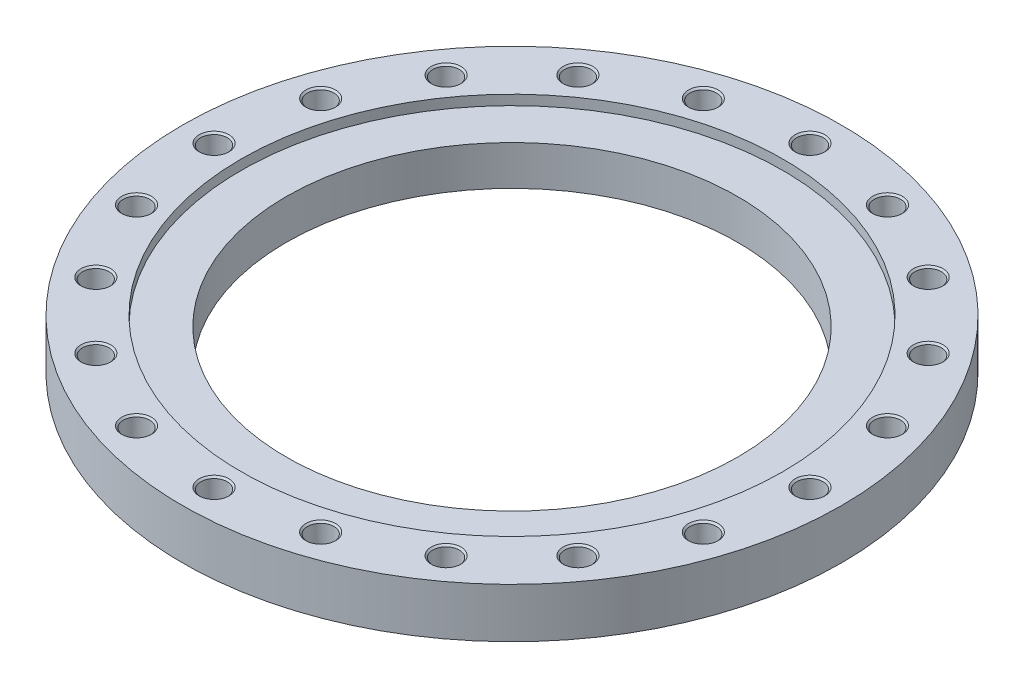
ISO-10303-21;
HEADER;
FILE_DESCRIPTION(('STEP AP214'),'2;1');
FILE_NAME('part.step','',(''),(''),'','','');
FILE_SCHEMA(('AUTOMOTIVE_DESIGN { 1 0 10303 214 1 1 1 1 }'));
ENDSEC;
DATA;
#1=APPLICATION_CONTEXT('core data for automotive mechanical design processes');
#2=APPLICATION_PROTOCOL_DEFINITION('international standard','automotive_design',2000,#1);
#3=PRODUCT_CONTEXT('',#1,'mechanical');
#4=PRODUCT('Part','Part','',(#3));
#5=PRODUCT_RELATED_PRODUCT_CATEGORY('part','',(#4));
#6=PRODUCT_DEFINITION_FORMATION('','',#4);
#7=PRODUCT_DEFINITION_CONTEXT('part definition',#1,'design');
#8=PRODUCT_DEFINITION('design','',#6,#7);
#9=PRODUCT_DEFINITION_SHAPE('','',#8);
#10=(LENGTH_UNIT() NAMED_UNIT(*) SI_UNIT(.MILLI.,.METRE.));
#11=(NAMED_UNIT(*) PLANE_ANGLE_UNIT() SI_UNIT($,.RADIAN.));
#12=(NAMED_UNIT(*) SI_UNIT($,.STERADIAN.) SOLID_ANGLE_UNIT());
#13=UNCERTAINTY_MEASURE_WITH_UNIT(LENGTH_MEASURE(1.E-05),#10,'distance_accuracy_value','');
#14=(GEOMETRIC_REPRESENTATION_CONTEXT(3) GLOBAL_UNCERTAINTY_ASSIGNED_CONTEXT((#13)) GLOBAL_UNIT_ASSIGNED_CONTEXT((#10,
#11,#12)) REPRESENTATION_CONTEXT('',''));
#15=CARTESIAN_POINT('',(0.,0.,0.));
#16=DIRECTION('',(0.,0.,1.));
#17=DIRECTION('',(1.,0.,0.));
#18=AXIS2_PLACEMENT_3D('',#15,#16,#17);
#19=CARTESIAN_POINT('',(0.,27.5,0.));
#20=DIRECTION('',(0.,-1.,0.));
#21=DIRECTION('',(1.,0.,0.));
#22=AXIS2_PLACEMENT_3D('',#19,#20,#21);
#23=CYLINDRICAL_SURFACE('',#22,365.);
#24=CARTESIAN_POINT('',(0.,0.,0.));
#25=DIRECTION('',(0.,1.,0.));
#26=DIRECTION('',(1.,0.,0.));
#27=AXIS2_PLACEMENT_3D('',#24,#25,#26);
#28=CIRCLE('',#27,365.);
#29=CARTESIAN_POINT('',(365.,0.,0.));
#30=VERTEX_POINT('',#29);
#31=EDGE_CURVE('E9',#30,#30,#28,.T.);
#32=ORIENTED_EDGE('',*,*,#31,.T.);
#33=EDGE_LOOP('',(#32));
#34=FACE_BOUND('',#33,.T.);
#35=CARTESIAN_POINT('',(0.,55.,0.));
#36=DIRECTION('',(0.,1.,0.));
#37=DIRECTION('',(1.,0.,0.));
#38=AXIS2_PLACEMENT_3D('',#35,#36,#37);
#39=CIRCLE('',#38,365.);
#40=CARTESIAN_POINT('',(365.,55.,0.));
#41=VERTEX_POINT('',#40);
#42=EDGE_CURVE('E656',#41,#41,#39,.T.);
#43=ORIENTED_EDGE('',*,*,#42,.F.);
#44=EDGE_LOOP('',(#43));
#45=FACE_BOUND('',#44,.T.);
#46=ADVANCED_FACE('F15',(#34,#45),#23,.T.);
#47=CARTESIAN_POINT('',(307.5,0.,0.));
#48=DIRECTION('',(0.,-1.,0.));
#49=DIRECTION('',(-1.,0.,0.));
#50=AXIS2_PLACEMENT_3D('',#47,#48,#49);
#51=PLANE('',#50);
#52=CARTESIAN_POINT('',(0.,0.,0.));
#53=DIRECTION('',(0.,1.,0.));
#54=DIRECTION('',(1.,0.,0.));
#55=AXIS2_PLACEMENT_3D('',#52,#53,#54);
#56=CIRCLE('',#55,250.);
#57=CARTESIAN_POINT('',(250.,0.,0.));
#58=VERTEX_POINT('',#57);
#59=EDGE_CURVE('E23',#58,#58,#56,.T.);
#60=ORIENTED_EDGE('',*,*,#59,.T.);
#61=EDGE_LOOP('',(#60));
#62=FACE_BOUND('',#61,.T.);
#63=ORIENTED_EDGE('',*,*,#31,.F.);
#64=EDGE_LOOP('',(#63));
#65=FACE_BOUND('',#64,.T.);
#66=ADVANCED_FACE('F482',(#62,#65),#51,.T.);
#67=CARTESIAN_POINT('',(0.,27.5,0.));
#68=DIRECTION('',(0.,-1.,0.));
#69=DIRECTION('',(1.,0.,0.));
#70=AXIS2_PLACEMENT_3D('',#67,#68,#69);
#71=CYLINDRICAL_SURFACE('',#70,250.);
#72=ORIENTED_EDGE('',*,*,#59,.F.);
#73=EDGE_LOOP('',(#72));
#74=FACE_BOUND('',#73,.T.);
#75=CARTESIAN_POINT('',(0.,44.,0.));
#76=DIRECTION('',(0.,1.,0.));
#77=DIRECTION('',(1.,0.,0.));
#78=AXIS2_PLACEMENT_3D('',#75,#76,#77);
#79=CIRCLE('',#78,250.);
#80=CARTESIAN_POINT('',(-250.,44.,0.));
#81=VERTEX_POINT('',#80);
#82=EDGE_CURVE('E650',#81,#81,#79,.T.);
#83=ORIENTED_EDGE('',*,*,#82,.T.);
#84=EDGE_LOOP('',(#83));
#85=FACE_BOUND('',#84,.T.);
#86=ADVANCED_FACE('F487',(#74,#85),#71,.F.);
#87=CARTESIAN_POINT('',(307.5,55.,0.));
#88=DIRECTION('',(0.,1.,0.));
#89=DIRECTION('',(1.,0.,0.));
#90=AXIS2_PLACEMENT_3D('',#87,#88,#89);
#91=PLANE('',#90);
#92=ORIENTED_EDGE('',*,*,#42,.T.);
#93=EDGE_LOOP('',(#92));
#94=FACE_BOUND('',#93,.T.);
#95=CARTESIAN_POINT('',(0.,55.,0.));
#96=DIRECTION('',(0.,-1.,0.));
#97=DIRECTION('',(1.,0.,0.));
#98=AXIS2_PLACEMENT_3D('',#95,#96,#97);
#99=CIRCLE('',#98,300.);
#100=CARTESIAN_POINT('',(-300.,55.,0.));
#101=VERTEX_POINT('',#100);
#102=EDGE_CURVE('E651',#101,#101,#99,.T.);
#103=ORIENTED_EDGE('',*,*,#102,.T.);
#104=EDGE_LOOP('',(#103));
#105=FACE_BOUND('',#104,.T.);
#106=CARTESIAN_POINT('',(330.,55.,0.));
#107=DIRECTION('',(0.,-1.,0.));
#108=DIRECTION('',(1.,0.,0.));
#109=AXIS2_PLACEMENT_3D('',#106,#107,#108);
#110=CIRCLE('',#109,16.5);
#111=CARTESIAN_POINT('',(346.5,55.,0.));
#112=VERTEX_POINT('',#111);
#113=EDGE_CURVE('E640',#112,#112,#110,.T.);
#114=ORIENTED_EDGE('',*,*,#113,.T.);
#115=EDGE_LOOP('',(#114));
#116=FACE_BOUND('',#115,.T.);
#117=CARTESIAN_POINT('',(313.848650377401,55.,-101.975608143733));
#118=DIRECTION('',(0.,-1.,0.));
#119=DIRECTION('',(0.951056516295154,0.,-0.309016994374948));
#120=AXIS2_PLACEMENT_3D('',#117,#118,#119);
#121=CIRCLE('',#120,16.5);
#122=CARTESIAN_POINT('',(329.54108289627,55.,-107.074388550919));
#123=VERTEX_POINT('',#122);
#124=EDGE_CURVE('E715',#123,#123,#121,.T.);
#125=ORIENTED_EDGE('',*,*,#124,.T.);
#126=EDGE_LOOP('',(#125));
#127=FACE_BOUND('',#126,.T.);
#128=CARTESIAN_POINT('',(266.975608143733,55.,-193.969133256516));
#129=DIRECTION('',(0.,-1.,0.));
#130=DIRECTION('',(0.809016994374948,0.,-0.587785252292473));
#131=AXIS2_PLACEMENT_3D('',#128,#129,#130);
#132=CIRCLE('',#131,16.5);
#133=CARTESIAN_POINT('',(280.324388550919,55.,-203.667589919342));
#134=VERTEX_POINT('',#133);
#135=EDGE_CURVE('E705',#134,#134,#132,.T.);
#136=ORIENTED_EDGE('',*,*,#135,.T.);
#137=EDGE_LOOP('',(#136));
#138=FACE_BOUND('',#137,.T.);
#139=CARTESIAN_POINT('',(193.969133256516,55.,-266.975608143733));
#140=DIRECTION('',(0.,-1.,0.));
#141=DIRECTION('',(0.587785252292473,0.,-0.809016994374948));
#142=AXIS2_PLACEMENT_3D('',#139,#140,#141);
#143=CIRCLE('',#142,16.5);
#144=CARTESIAN_POINT('',(203.667589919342,55.,-280.324388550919));
#145=VERTEX_POINT('',#144);
#146=EDGE_CURVE('E698',#145,#145,#143,.T.);
#147=ORIENTED_EDGE('',*,*,#146,.T.);
#148=EDGE_LOOP('',(#147));
#149=FACE_BOUND('',#148,.T.);
#150=CARTESIAN_POINT('',(101.975608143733,55.,-313.848650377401));
#151=DIRECTION('',(0.,-1.,0.));
#152=DIRECTION('',(0.309016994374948,0.,-0.951056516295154));
#153=AXIS2_PLACEMENT_3D('',#150,#151,#152);
#154=CIRCLE('',#153,16.5);
#155=CARTESIAN_POINT('',(107.074388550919,55.,-329.54108289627));
#156=VERTEX_POINT('',#155);
#157=EDGE_CURVE('E658',#156,#156,#154,.T.);
#158=ORIENTED_EDGE('',*,*,#157,.T.);
#159=EDGE_LOOP('',(#158));
#160=FACE_BOUND('',#159,.T.);
#161=CARTESIAN_POINT('',(0.,55.,-330.));
#162=DIRECTION('',(0.,-1.,0.));
#163=DIRECTION('',(0.,0.,-1.));
#164=AXIS2_PLACEMENT_3D('',#161,#162,#163);
#165=CIRCLE('',#164,16.5);
#166=CARTESIAN_POINT('',(0.,55.,-346.5));
#167=VERTEX_POINT('',#166);
#168=EDGE_CURVE('E666',#167,#167,#165,.T.);
#169=ORIENTED_EDGE('',*,*,#168,.T.);
#170=EDGE_LOOP('',(#169));
#171=FACE_BOUND('',#170,.T.);
#172=CARTESIAN_POINT('',(-101.975608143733,55.,-313.848650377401));
#173=DIRECTION('',(0.,-1.,0.));
#174=DIRECTION('',(-0.309016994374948,0.,-0.951056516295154));
#175=AXIS2_PLACEMENT_3D('',#172,#173,#174);
#176=CIRCLE('',#175,16.5);
#177=CARTESIAN_POINT('',(-107.074388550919,55.,-329.54108289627));
#178=VERTEX_POINT('',#177);
#179=EDGE_CURVE('E681',#178,#178,#176,.T.);
#180=ORIENTED_EDGE('',*,*,#179,.T.);
#181=EDGE_LOOP('',(#180));
#182=FACE_BOUND('',#181,.T.);
#183=CARTESIAN_POINT('',(-193.969133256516,55.,-266.975608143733));
#184=DIRECTION('',(0.,-1.,0.));
#185=DIRECTION('',(-0.587785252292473,0.,-0.809016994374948));
#186=AXIS2_PLACEMENT_3D('',#183,#184,#185);
#187=CIRCLE('',#186,16.5);
#188=CARTESIAN_POINT('',(-203.667589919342,55.,-280.324388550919));
#189=VERTEX_POINT('',#188);
#190=EDGE_CURVE('E668',#189,#189,#187,.T.);
#191=ORIENTED_EDGE('',*,*,#190,.T.);
#192=EDGE_LOOP('',(#191));
#193=FACE_BOUND('',#192,.T.);
#194=CARTESIAN_POINT('',(-266.975608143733,55.,-193.969133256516));
#195=DIRECTION('',(0.,-1.,0.));
#196=DIRECTION('',(-0.809016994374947,0.,-0.587785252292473));
#197=AXIS2_PLACEMENT_3D('',#194,#195,#196);
#198=CIRCLE('',#197,16.5);
#199=CARTESIAN_POINT('',(-280.324388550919,55.,-203.667589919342));
#200=VERTEX_POINT('',#199);
#201=EDGE_CURVE('E647',#200,#200,#198,.T.);
#202=ORIENTED_EDGE('',*,*,#201,.T.);
#203=EDGE_LOOP('',(#202));
#204=FACE_BOUND('',#203,.T.);
#205=CARTESIAN_POINT('',(-313.848650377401,55.,-101.975608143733));
#206=DIRECTION('',(0.,-1.,0.));
#207=DIRECTION('',(-0.951056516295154,0.,-0.309016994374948));
#208=AXIS2_PLACEMENT_3D('',#205,#206,#207);
#209=CIRCLE('',#208,16.5);
#210=CARTESIAN_POINT('',(-329.54108289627,55.,-107.074388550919));
#211=VERTEX_POINT('',#210);
#212=EDGE_CURVE('E795',#211,#211,#209,.T.);
#213=ORIENTED_EDGE('',*,*,#212,.T.);
#214=EDGE_LOOP('',(#213));
#215=FACE_BOUND('',#214,.T.);
#216=CARTESIAN_POINT('',(-330.,55.,0.));
#217=DIRECTION('',(0.,-1.,0.));
#218=DIRECTION('',(-1.,0.,0.));
#219=AXIS2_PLACEMENT_3D('',#216,#217,#218);
#220=CIRCLE('',#219,16.5);
#221=CARTESIAN_POINT('',(-346.5,55.,0.));
#222=VERTEX_POINT('',#221);
#223=EDGE_CURVE('E751',#222,#222,#220,.T.);
#224=ORIENTED_EDGE('',*,*,#223,.T.);
#225=EDGE_LOOP('',(#224));
#226=FACE_BOUND('',#225,.T.);
#227=CARTESIAN_POINT('',(-313.848650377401,55.,101.975608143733));
#228=DIRECTION('',(0.,-1.,0.));
#229=DIRECTION('',(-0.951056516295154,0.,0.309016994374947));
#230=AXIS2_PLACEMENT_3D('',#227,#228,#229);
#231=CIRCLE('',#230,16.5);
#232=CARTESIAN_POINT('',(-329.54108289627,55.,107.074388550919));
#233=VERTEX_POINT('',#232);
#234=EDGE_CURVE('E774',#233,#233,#231,.T.);
#235=ORIENTED_EDGE('',*,*,#234,.T.);
#236=EDGE_LOOP('',(#235));
#237=FACE_BOUND('',#236,.T.);
#238=CARTESIAN_POINT('',(-266.975608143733,55.,193.969133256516));
#239=DIRECTION('',(0.,-1.,0.));
#240=DIRECTION('',(-0.809016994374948,0.,0.587785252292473));
#241=AXIS2_PLACEMENT_3D('',#238,#239,#240);
#242=CIRCLE('',#241,16.5);
#243=CARTESIAN_POINT('',(-280.324388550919,55.,203.667589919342));
#244=VERTEX_POINT('',#243);
#245=EDGE_CURVE('E739',#244,#244,#242,.T.);
#246=ORIENTED_EDGE('',*,*,#245,.T.);
#247=EDGE_LOOP('',(#246));
#248=FACE_BOUND('',#247,.T.);
#249=CARTESIAN_POINT('',(-193.969133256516,55.,266.975608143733));
#250=DIRECTION('',(0.,-1.,0.));
#251=DIRECTION('',(-0.587785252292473,0.,0.809016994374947));
#252=AXIS2_PLACEMENT_3D('',#249,#250,#251);
#253=CIRCLE('',#252,16.5);
#254=CARTESIAN_POINT('',(-203.667589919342,55.,280.324388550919));
#255=VERTEX_POINT('',#254);
#256=EDGE_CURVE('E747',#255,#255,#253,.T.);
#257=ORIENTED_EDGE('',*,*,#256,.T.);
#258=EDGE_LOOP('',(#257));
#259=FACE_BOUND('',#258,.T.);
#260=CARTESIAN_POINT('',(-101.975608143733,55.,313.848650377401));
#261=DIRECTION('',(0.,-1.,0.));
#262=DIRECTION('',(-0.309016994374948,0.,0.951056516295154));
#263=AXIS2_PLACEMENT_3D('',#260,#261,#262);
#264=CIRCLE('',#263,16.5);
#265=CARTESIAN_POINT('',(-107.074388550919,55.,329.54108289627));
#266=VERTEX_POINT('',#265);
#267=EDGE_CURVE('E730',#266,#266,#264,.T.);
#268=ORIENTED_EDGE('',*,*,#267,.T.);
#269=EDGE_LOOP('',(#268));
#270=FACE_BOUND('',#269,.T.);
#271=CARTESIAN_POINT('',(0.,55.,330.));
#272=DIRECTION('',(0.,-1.,0.));
#273=DIRECTION('',(0.,0.,1.));
#274=AXIS2_PLACEMENT_3D('',#271,#272,#273);
#275=CIRCLE('',#274,16.5);
#276=CARTESIAN_POINT('',(0.,55.,346.5));
#277=VERTEX_POINT('',#276);
#278=EDGE_CURVE('E1559',#277,#277,#275,.T.);
#279=ORIENTED_EDGE('',*,*,#278,.T.);
#280=EDGE_LOOP('',(#279));
#281=FACE_BOUND('',#280,.T.);
#282=CARTESIAN_POINT('',(101.975608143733,55.,313.848650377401));
#283=DIRECTION('',(0.,-1.,0.));
#284=DIRECTION('',(0.309016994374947,0.,0.951056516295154));
#285=AXIS2_PLACEMENT_3D('',#282,#283,#284);
#286=CIRCLE('',#285,16.5);
#287=CARTESIAN_POINT('',(107.074388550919,55.,329.54108289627));
#288=VERTEX_POINT('',#287);
#289=EDGE_CURVE('E1562',#288,#288,#286,.T.);
#290=ORIENTED_EDGE('',*,*,#289,.T.);
#291=EDGE_LOOP('',(#290));
#292=FACE_BOUND('',#291,.T.);
#293=CARTESIAN_POINT('',(193.969133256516,55.,266.975608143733));
#294=DIRECTION('',(0.,-1.,0.));
#295=DIRECTION('',(0.587785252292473,0.,0.809016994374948));
#296=AXIS2_PLACEMENT_3D('',#293,#294,#295);
#297=CIRCLE('',#296,16.5);
#298=CARTESIAN_POINT('',(203.667589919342,55.,280.324388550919));
#299=VERTEX_POINT('',#298);
#300=EDGE_CURVE('E1565',#299,#299,#297,.T.);
#301=ORIENTED_EDGE('',*,*,#300,.T.);
#302=EDGE_LOOP('',(#301));
#303=FACE_BOUND('',#302,.T.);
#304=CARTESIAN_POINT('',(266.975608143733,55.,193.969133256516));
#305=DIRECTION('',(0.,-1.,0.));
#306=DIRECTION('',(0.809016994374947,0.,0.587785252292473));
#307=AXIS2_PLACEMENT_3D('',#304,#305,#306);
#308=CIRCLE('',#307,16.5);
#309=CARTESIAN_POINT('',(280.324388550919,55.,203.667589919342));
#310=VERTEX_POINT('',#309);
#311=EDGE_CURVE('E1568',#310,#310,#308,.T.);
#312=ORIENTED_EDGE('',*,*,#311,.T.);
#313=EDGE_LOOP('',(#312));
#314=FACE_BOUND('',#313,.T.);
#315=CARTESIAN_POINT('',(313.848650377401,55.,101.975608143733));
#316=DIRECTION('',(0.,-1.,0.));
#317=DIRECTION('',(0.951056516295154,0.,0.309016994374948));
#318=AXIS2_PLACEMENT_3D('',#315,#316,#317);
#319=CIRCLE('',#318,16.5);
#320=CARTESIAN_POINT('',(329.54108289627,55.,107.074388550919));
#321=VERTEX_POINT('',#320);
#322=EDGE_CURVE('E1570',#321,#321,#319,.T.);
#323=ORIENTED_EDGE('',*,*,#322,.T.);
#324=EDGE_LOOP('',(#323));
#325=FACE_BOUND('',#324,.T.);
#326=ADVANCED_FACE('F608',(#94,#105,#116,#127,#138,#149,#160,#171,#182,#193,#204,#215,#226,#237,
#248,#259,#270,#281,#292,#303,#314,#325),#91,.T.);
#327=CARTESIAN_POINT('',(0.,44.,0.));
#328=DIRECTION('',(0.,-1.,0.));
#329=DIRECTION('',(-1.,0.,0.));
#330=AXIS2_PLACEMENT_3D('',#327,#328,#329);
#331=PLANE('',#330);
#332=CARTESIAN_POINT('',(0.,44.,0.));
#333=DIRECTION('',(0.,-1.,0.));
#334=DIRECTION('',(1.,0.,0.));
#335=AXIS2_PLACEMENT_3D('',#332,#333,#334);
#336=CIRCLE('',#335,300.);
#337=CARTESIAN_POINT('',(300.,44.,0.));
#338=VERTEX_POINT('',#337);
#339=EDGE_CURVE('E648',#338,#338,#336,.T.);
#340=ORIENTED_EDGE('',*,*,#339,.F.);
#341=EDGE_LOOP('',(#340));
#342=FACE_BOUND('',#341,.T.);
#343=ORIENTED_EDGE('',*,*,#82,.F.);
#344=EDGE_LOOP('',(#343));
#345=FACE_BOUND('',#344,.T.);
#346=ADVANCED_FACE('F605',(#342,#345),#331,.F.);
#347=CARTESIAN_POINT('',(0.,52.25,0.));
#348=DIRECTION('',(0.,-1.,0.));
#349=DIRECTION('',(1.,0.,0.));
#350=AXIS2_PLACEMENT_3D('',#347,#348,#349);
#351=CYLINDRICAL_SURFACE('',#350,300.);
#352=ORIENTED_EDGE('',*,*,#339,.T.);
#353=EDGE_LOOP('',(#352));
#354=FACE_BOUND('',#353,.T.);
#355=ORIENTED_EDGE('',*,*,#102,.F.);
#356=EDGE_LOOP('',(#355));
#357=FACE_BOUND('',#356,.T.);
#358=ADVANCED_FACE('F17',(#354,#357),#351,.F.);
#359=CARTESIAN_POINT('',(330.,7.78371923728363,0.));
#360=DIRECTION('',(0.,1.,0.));
#361=DIRECTION('',(1.,0.,0.));
#362=AXIS2_PLACEMENT_3D('',#359,#360,#361);
#363=CONICAL_SURFACE('',#362,7.3028125,1.0471975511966);
#364=CARTESIAN_POINT('',(330.,12.,0.));
#365=DIRECTION('',(0.,-1.,0.));
#366=DIRECTION('',(1.,0.,0.));
#367=AXIS2_PLACEMENT_3D('',#364,#365,#366);
#368=CIRCLE('',#367,14.605625);
#369=CARTESIAN_POINT('',(344.605625,12.,0.));
#370=VERTEX_POINT('',#369);
#371=EDGE_CURVE('E722',#370,#370,#368,.T.);
#372=ORIENTED_EDGE('',*,*,#371,.F.);
#373=EDGE_LOOP('',(#372));
#374=FACE_BOUND('',#373,.T.);
#375=CARTESIAN_POINT('',(330.,3.56743847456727,0.));
#376=VERTEX_POINT('',#375);
#377=VERTEX_LOOP('',#376);
#378=FACE_BOUND('',#377,.T.);
#379=ADVANCED_FACE('F523',(#374,#378),#363,.F.);
#380=CARTESIAN_POINT('',(330.,16.5528125,0.));
#381=DIRECTION('',(0.,1.,0.));
#382=DIRECTION('',(1.,0.,0.));
#383=AXIS2_PLACEMENT_3D('',#380,#381,#382);
#384=CYLINDRICAL_SURFACE('',#383,14.605625);
#385=CARTESIAN_POINT('',(330.,21.105625,0.));
#386=DIRECTION('',(0.,-1.,0.));
#387=DIRECTION('',(1.,0.,0.));
#388=AXIS2_PLACEMENT_3D('',#385,#386,#387);
#389=CIRCLE('',#388,14.605625);
#390=CARTESIAN_POINT('',(344.605625,21.105625,0.));
#391=VERTEX_POINT('',#390);
#392=EDGE_CURVE('E721',#391,#391,#389,.T.);
#393=ORIENTED_EDGE('',*,*,#392,.F.);
#394=EDGE_LOOP('',(#393));
#395=FACE_BOUND('',#394,.T.);
#396=ORIENTED_EDGE('',*,*,#371,.T.);
#397=EDGE_LOOP('',(#396));
#398=FACE_BOUND('',#397,.T.);
#399=ADVANCED_FACE('F519',(#395,#398),#384,.F.);
#400=CARTESIAN_POINT('',(330.,22.0528125,0.));
#401=DIRECTION('',(0.,1.,0.));
#402=DIRECTION('',(1.,0.,0.));
#403=AXIS2_PLACEMENT_3D('',#400,#401,#402);
#404=CONICAL_SURFACE('',#403,15.5528125,0.785398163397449);
#405=CARTESIAN_POINT('',(330.,23.,0.));
#406=DIRECTION('',(0.,-1.,0.));
#407=DIRECTION('',(1.,0.,0.));
#408=AXIS2_PLACEMENT_3D('',#405,#406,#407);
#409=CIRCLE('',#408,16.5);
#410=CARTESIAN_POINT('',(346.5,23.,0.));
#411=VERTEX_POINT('',#410);
#412=EDGE_CURVE('E639',#411,#411,#409,.T.);
#413=ORIENTED_EDGE('',*,*,#412,.F.);
#414=EDGE_LOOP('',(#413));
#415=FACE_BOUND('',#414,.T.);
#416=ORIENTED_EDGE('',*,*,#392,.T.);
#417=EDGE_LOOP('',(#416));
#418=FACE_BOUND('',#417,.T.);
#419=ADVANCED_FACE('F522',(#415,#418),#404,.F.);
#420=CARTESIAN_POINT('',(345.5528125,23.,0.));
#421=DIRECTION('',(0.,1.,0.));
#422=DIRECTION('',(-1.,0.,0.));
#423=AXIS2_PLACEMENT_3D('',#420,#421,#422);
#424=PLANE('',#423);
#425=CARTESIAN_POINT('',(330.,23.,0.));
#426=DIRECTION('',(0.,-1.,0.));
#427=DIRECTION('',(1.,0.,0.));
#428=AXIS2_PLACEMENT_3D('',#425,#426,#427);
#429=CIRCLE('',#428,14.605625);
#430=CARTESIAN_POINT('',(344.605625,23.,0.));
#431=VERTEX_POINT('',#430);
#432=EDGE_CURVE('E638',#431,#431,#429,.T.);
#433=ORIENTED_EDGE('',*,*,#432,.F.);
#434=EDGE_LOOP('',(#433));
#435=FACE_BOUND('',#434,.T.);
#436=ORIENTED_EDGE('',*,*,#412,.T.);
#437=EDGE_LOOP('',(#436));
#438=FACE_BOUND('',#437,.T.);
#439=ADVANCED_FACE('F534',(#435,#438),#424,.F.);
#440=CARTESIAN_POINT('',(330.,38.0528125,0.));
#441=DIRECTION('',(0.,1.,0.));
#442=DIRECTION('',(1.,0.,0.));
#443=AXIS2_PLACEMENT_3D('',#440,#441,#442);
#444=CYLINDRICAL_SURFACE('',#443,14.605625);
#445=CARTESIAN_POINT('',(330.,53.105625,0.));
#446=DIRECTION('',(0.,-1.,0.));
#447=DIRECTION('',(1.,0.,0.));
#448=AXIS2_PLACEMENT_3D('',#445,#446,#447);
#449=CIRCLE('',#448,14.605625);
#450=CARTESIAN_POINT('',(344.605625,53.105625,0.));
#451=VERTEX_POINT('',#450);
#452=EDGE_CURVE('E643',#451,#451,#449,.T.);
#453=ORIENTED_EDGE('',*,*,#452,.F.);
#454=EDGE_LOOP('',(#453));
#455=FACE_BOUND('',#454,.T.);
#456=ORIENTED_EDGE('',*,*,#432,.T.);
#457=EDGE_LOOP('',(#456));
#458=FACE_BOUND('',#457,.T.);
#459=ADVANCED_FACE('F530',(#455,#458),#444,.F.);
#460=CARTESIAN_POINT('',(330.,54.0528125,0.));
#461=DIRECTION('',(0.,1.,0.));
#462=DIRECTION('',(1.,0.,0.));
#463=AXIS2_PLACEMENT_3D('',#460,#461,#462);
#464=CONICAL_SURFACE('',#463,15.5528125,0.785398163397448);
#465=ORIENTED_EDGE('',*,*,#113,.F.);
#466=EDGE_LOOP('',(#465));
#467=FACE_BOUND('',#466,.T.);
#468=ORIENTED_EDGE('',*,*,#452,.T.);
#469=EDGE_LOOP('',(#468));
#470=FACE_BOUND('',#469,.T.);
#471=ADVANCED_FACE('F533',(#467,#470),#464,.F.);
#472=CARTESIAN_POINT('',(313.848650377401,7.78371923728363,-101.975608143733));
#473=DIRECTION('',(0.,1.,0.));
#474=DIRECTION('',(0.951056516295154,0.,-0.309016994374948));
#475=AXIS2_PLACEMENT_3D('',#472,#473,#474);
#476=CONICAL_SURFACE('',#475,7.3028125,1.0471975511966);
#477=CARTESIAN_POINT('',(313.848650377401,12.,-101.975608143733));
#478=DIRECTION('',(0.,-1.,0.));
#479=DIRECTION('',(0.951056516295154,0.,-0.309016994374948));
#480=AXIS2_PLACEMENT_3D('',#477,#478,#479);
#481=CIRCLE('',#480,14.605625);
#482=CARTESIAN_POINT('',(327.739425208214,12.,-106.4889944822));
#483=VERTEX_POINT('',#482);
#484=EDGE_CURVE('E718',#483,#483,#481,.T.);
#485=ORIENTED_EDGE('',*,*,#484,.F.);
#486=EDGE_LOOP('',(#485));
#487=FACE_BOUND('',#486,.T.);
#488=CARTESIAN_POINT('',(313.848650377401,3.56743847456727,-101.975608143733));
#489=VERTEX_POINT('',#488);
#490=VERTEX_LOOP('',#489);
#491=FACE_BOUND('',#490,.T.);
#492=ADVANCED_FACE('F584',(#487,#491),#476,.F.);
#493=CARTESIAN_POINT('',(313.848650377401,16.5528125,-101.975608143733));
#494=DIRECTION('',(0.,1.,0.));
#495=DIRECTION('',(0.951056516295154,0.,-0.309016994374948));
#496=AXIS2_PLACEMENT_3D('',#493,#494,#495);
#497=CYLINDRICAL_SURFACE('',#496,14.605625);
#498=CARTESIAN_POINT('',(313.848650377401,21.105625,-101.975608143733));
#499=DIRECTION('',(0.,-1.,0.));
#500=DIRECTION('',(0.951056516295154,0.,-0.309016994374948));
#501=AXIS2_PLACEMENT_3D('',#498,#499,#500);
#502=CIRCLE('',#501,14.605625);
#503=CARTESIAN_POINT('',(327.739425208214,21.105625,-106.4889944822));
#504=VERTEX_POINT('',#503);
#505=EDGE_CURVE('E716',#504,#504,#502,.T.);
#506=ORIENTED_EDGE('',*,*,#505,.F.);
#507=EDGE_LOOP('',(#506));
#508=FACE_BOUND('',#507,.T.);
#509=ORIENTED_EDGE('',*,*,#484,.T.);
#510=EDGE_LOOP('',(#509));
#511=FACE_BOUND('',#510,.T.);
#512=ADVANCED_FACE('F587',(#508,#511),#497,.F.);
#513=CARTESIAN_POINT('',(313.848650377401,22.0528125,-101.975608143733));
#514=DIRECTION('',(0.,1.,0.));
#515=DIRECTION('',(0.951056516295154,0.,-0.309016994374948));
#516=AXIS2_PLACEMENT_3D('',#513,#514,#515);
#517=CONICAL_SURFACE('',#516,15.5528125,0.785398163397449);
#518=CARTESIAN_POINT('',(313.848650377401,23.,-101.975608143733));
#519=DIRECTION('',(0.,-1.,0.));
#520=DIRECTION('',(0.951056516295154,0.,-0.309016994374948));
#521=AXIS2_PLACEMENT_3D('',#518,#519,#520);
#522=CIRCLE('',#521,16.5);
#523=CARTESIAN_POINT('',(329.54108289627,23.,-107.074388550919));
#524=VERTEX_POINT('',#523);
#525=EDGE_CURVE('E719',#524,#524,#522,.T.);
#526=ORIENTED_EDGE('',*,*,#525,.F.);
#527=EDGE_LOOP('',(#526));
#528=FACE_BOUND('',#527,.T.);
#529=ORIENTED_EDGE('',*,*,#505,.T.);
#530=EDGE_LOOP('',(#529));
#531=FACE_BOUND('',#530,.T.);
#532=ADVANCED_FACE('F498',(#528,#531),#517,.F.);
#533=CARTESIAN_POINT('',(328.640254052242,23.,-106.78169151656));
#534=DIRECTION('',(0.,1.,0.));
#535=DIRECTION('',(-0.951056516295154,0.,0.309016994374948));
#536=AXIS2_PLACEMENT_3D('',#533,#534,#535);
#537=PLANE('',#536);
#538=CARTESIAN_POINT('',(313.848650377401,23.,-101.975608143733));
#539=DIRECTION('',(0.,-1.,0.));
#540=DIRECTION('',(0.951056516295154,0.,-0.309016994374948));
#541=AXIS2_PLACEMENT_3D('',#538,#539,#540);
#542=CIRCLE('',#541,14.605625);
#543=CARTESIAN_POINT('',(327.739425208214,23.,-106.4889944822));
#544=VERTEX_POINT('',#543);
#545=EDGE_CURVE('E761',#544,#544,#542,.T.);
#546=ORIENTED_EDGE('',*,*,#545,.F.);
#547=EDGE_LOOP('',(#546));
#548=FACE_BOUND('',#547,.T.);
#549=ORIENTED_EDGE('',*,*,#525,.T.);
#550=EDGE_LOOP('',(#549));
#551=FACE_BOUND('',#550,.T.);
#552=ADVANCED_FACE('F494',(#548,#551),#537,.F.);
#553=CARTESIAN_POINT('',(313.848650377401,38.0528125,-101.975608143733));
#554=DIRECTION('',(0.,1.,0.));
#555=DIRECTION('',(0.951056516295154,0.,-0.309016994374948));
#556=AXIS2_PLACEMENT_3D('',#553,#554,#555);
#557=CYLINDRICAL_SURFACE('',#556,14.605625);
#558=CARTESIAN_POINT('',(313.848650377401,53.105625,-101.975608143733));
#559=DIRECTION('',(0.,-1.,0.));
#560=DIRECTION('',(0.951056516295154,0.,-0.309016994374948));
#561=AXIS2_PLACEMENT_3D('',#558,#559,#560);
#562=CIRCLE('',#561,14.605625);
#563=CARTESIAN_POINT('',(327.739425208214,53.105625,-106.4889944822));
#564=VERTEX_POINT('',#563);
#565=EDGE_CURVE('E712',#564,#564,#562,.T.);
#566=ORIENTED_EDGE('',*,*,#565,.F.);
#567=EDGE_LOOP('',(#566));
#568=FACE_BOUND('',#567,.T.);
#569=ORIENTED_EDGE('',*,*,#545,.T.);
#570=EDGE_LOOP('',(#569));
#571=FACE_BOUND('',#570,.T.);
#572=ADVANCED_FACE('F497',(#568,#571),#557,.F.);
#573=CARTESIAN_POINT('',(313.848650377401,54.0528125,-101.975608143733));
#574=DIRECTION('',(0.,1.,0.));
#575=DIRECTION('',(0.951056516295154,0.,-0.309016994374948));
#576=AXIS2_PLACEMENT_3D('',#573,#574,#575);
#577=CONICAL_SURFACE('',#576,15.5528125,0.785398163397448);
#578=ORIENTED_EDGE('',*,*,#124,.F.);
#579=EDGE_LOOP('',(#578));
#580=FACE_BOUND('',#579,.T.);
#581=ORIENTED_EDGE('',*,*,#565,.T.);
#582=EDGE_LOOP('',(#581));
#583=FACE_BOUND('',#582,.T.);
#584=ADVANCED_FACE('F1400',(#580,#583),#577,.F.);
#585=CARTESIAN_POINT('',(266.975608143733,7.78371923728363,-193.969133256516));
#586=DIRECTION('',(0.,1.,0.));
#587=DIRECTION('',(0.809016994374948,0.,-0.587785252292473));
#588=AXIS2_PLACEMENT_3D('',#585,#586,#587);
#589=CONICAL_SURFACE('',#588,7.3028125,1.0471975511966);
#590=CARTESIAN_POINT('',(266.975608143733,12.,-193.969133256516));
#591=DIRECTION('',(0.,-1.,0.));
#592=DIRECTION('',(0.809016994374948,0.,-0.587785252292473));
#593=AXIS2_PLACEMENT_3D('',#590,#591,#592);
#594=CIRCLE('',#593,14.605625);
#595=CARTESIAN_POINT('',(278.7918069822,12.,-202.55410423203));
#596=VERTEX_POINT('',#595);
#597=EDGE_CURVE('E710',#596,#596,#594,.T.);
#598=ORIENTED_EDGE('',*,*,#597,.F.);
#599=EDGE_LOOP('',(#598));
#600=FACE_BOUND('',#599,.T.);
#601=CARTESIAN_POINT('',(266.975608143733,3.56743847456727,-193.969133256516));
#602=VERTEX_POINT('',#601);
#603=VERTEX_LOOP('',#602);
#604=FACE_BOUND('',#603,.T.);
#605=ADVANCED_FACE('F1390',(#600,#604),#589,.F.);
#606=CARTESIAN_POINT('',(266.975608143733,16.5528125,-193.969133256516));
#607=DIRECTION('',(0.,1.,0.));
#608=DIRECTION('',(0.809016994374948,0.,-0.587785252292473));
#609=AXIS2_PLACEMENT_3D('',#606,#607,#608);
#610=CYLINDRICAL_SURFACE('',#609,14.605625);
#611=CARTESIAN_POINT('',(266.975608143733,21.105625,-193.969133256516));
#612=DIRECTION('',(0.,-1.,0.));
#613=DIRECTION('',(0.809016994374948,0.,-0.587785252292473));
#614=AXIS2_PLACEMENT_3D('',#611,#612,#613);
#615=CIRCLE('',#614,14.605625);
#616=CARTESIAN_POINT('',(278.7918069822,21.105625,-202.55410423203));
#617=VERTEX_POINT('',#616);
#618=EDGE_CURVE('E713',#617,#617,#615,.T.);
#619=ORIENTED_EDGE('',*,*,#618,.F.);
#620=EDGE_LOOP('',(#619));
#621=FACE_BOUND('',#620,.T.);
#622=ORIENTED_EDGE('',*,*,#597,.T.);
#623=EDGE_LOOP('',(#622));
#624=FACE_BOUND('',#623,.T.);
#625=ADVANCED_FACE('F869',(#621,#624),#610,.F.);
#626=CARTESIAN_POINT('',(266.975608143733,22.0528125,-193.969133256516));
#627=DIRECTION('',(0.,1.,0.));
#628=DIRECTION('',(0.809016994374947,0.,-0.587785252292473));
#629=AXIS2_PLACEMENT_3D('',#626,#627,#628);
#630=CONICAL_SURFACE('',#629,15.5528125,0.785398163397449);
#631=CARTESIAN_POINT('',(266.975608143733,23.,-193.969133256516));
#632=DIRECTION('',(0.,-1.,0.));
#633=DIRECTION('',(0.809016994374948,0.,-0.587785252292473));
#634=AXIS2_PLACEMENT_3D('',#631,#632,#633);
#635=CIRCLE('',#634,16.5);
#636=CARTESIAN_POINT('',(280.324388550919,23.,-203.667589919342));
#637=VERTEX_POINT('',#636);
#638=EDGE_CURVE('E709',#637,#637,#635,.T.);
#639=ORIENTED_EDGE('',*,*,#638,.F.);
#640=EDGE_LOOP('',(#639));
#641=FACE_BOUND('',#640,.T.);
#642=ORIENTED_EDGE('',*,*,#618,.T.);
#643=EDGE_LOOP('',(#642));
#644=FACE_BOUND('',#643,.T.);
#645=ADVANCED_FACE('F865',(#641,#644),#630,.F.);
#646=CARTESIAN_POINT('',(279.55809776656,23.,-203.110847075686));
#647=DIRECTION('',(0.,1.,0.));
#648=DIRECTION('',(-0.809016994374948,0.,0.587785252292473));
#649=AXIS2_PLACEMENT_3D('',#646,#647,#648);
#650=PLANE('',#649);
#651=CARTESIAN_POINT('',(266.975608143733,23.,-193.969133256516));
#652=DIRECTION('',(0.,-1.,0.));
#653=DIRECTION('',(0.809016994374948,0.,-0.587785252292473));
#654=AXIS2_PLACEMENT_3D('',#651,#652,#653);
#655=CIRCLE('',#654,14.605625);
#656=CARTESIAN_POINT('',(278.7918069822,23.,-202.55410423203));
#657=VERTEX_POINT('',#656);
#658=EDGE_CURVE('E707',#657,#657,#655,.T.);
#659=ORIENTED_EDGE('',*,*,#658,.F.);
#660=EDGE_LOOP('',(#659));
#661=FACE_BOUND('',#660,.T.);
#662=ORIENTED_EDGE('',*,*,#638,.T.);
#663=EDGE_LOOP('',(#662));
#664=FACE_BOUND('',#663,.T.);
#665=ADVANCED_FACE('F868',(#661,#664),#650,.F.);
#666=CARTESIAN_POINT('',(266.975608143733,38.0528125,-193.969133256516));
#667=DIRECTION('',(0.,1.,0.));
#668=DIRECTION('',(0.809016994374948,0.,-0.587785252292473));
#669=AXIS2_PLACEMENT_3D('',#666,#667,#668);
#670=CYLINDRICAL_SURFACE('',#669,14.605625);
#671=CARTESIAN_POINT('',(266.975608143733,53.105625,-193.969133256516));
#672=DIRECTION('',(0.,-1.,0.));
#673=DIRECTION('',(0.809016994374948,0.,-0.587785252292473));
#674=AXIS2_PLACEMENT_3D('',#671,#672,#673);
#675=CIRCLE('',#674,14.605625);
#676=CARTESIAN_POINT('',(278.7918069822,53.105625,-202.55410423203));
#677=VERTEX_POINT('',#676);
#678=EDGE_CURVE('E703',#677,#677,#675,.T.);
#679=ORIENTED_EDGE('',*,*,#678,.F.);
#680=EDGE_LOOP('',(#679));
#681=FACE_BOUND('',#680,.T.);
#682=ORIENTED_EDGE('',*,*,#658,.T.);
#683=EDGE_LOOP('',(#682));
#684=FACE_BOUND('',#683,.T.);
#685=ADVANCED_FACE('F1356',(#681,#684),#670,.F.);
#686=CARTESIAN_POINT('',(266.975608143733,54.0528125,-193.969133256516));
#687=DIRECTION('',(0.,1.,0.));
#688=DIRECTION('',(0.809016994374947,0.,-0.587785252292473));
#689=AXIS2_PLACEMENT_3D('',#686,#687,#688);
#690=CONICAL_SURFACE('',#689,15.5528125,0.785398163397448);
#691=ORIENTED_EDGE('',*,*,#135,.F.);
#692=EDGE_LOOP('',(#691));
#693=FACE_BOUND('',#692,.T.);
#694=ORIENTED_EDGE('',*,*,#678,.T.);
#695=EDGE_LOOP('',(#694));
#696=FACE_BOUND('',#695,.T.);
#697=ADVANCED_FACE('F842',(#693,#696),#690,.F.);
#698=CARTESIAN_POINT('',(193.969133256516,7.78371923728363,-266.975608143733));
#699=DIRECTION('',(0.,1.,0.));
#700=DIRECTION('',(0.587785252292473,0.,-0.809016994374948));
#701=AXIS2_PLACEMENT_3D('',#698,#699,#700);
#702=CONICAL_SURFACE('',#701,7.3028125,1.0471975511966);
#703=CARTESIAN_POINT('',(193.969133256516,12.,-266.975608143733));
#704=DIRECTION('',(0.,-1.,0.));
#705=DIRECTION('',(0.587785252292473,0.,-0.809016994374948));
#706=AXIS2_PLACEMENT_3D('',#703,#704,#705);
#707=CIRCLE('',#706,14.605625);
#708=CARTESIAN_POINT('',(202.55410423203,12.,-278.7918069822));
#709=VERTEX_POINT('',#708);
#710=EDGE_CURVE('E706',#709,#709,#707,.T.);
#711=ORIENTED_EDGE('',*,*,#710,.F.);
#712=EDGE_LOOP('',(#711));
#713=FACE_BOUND('',#712,.T.);
#714=CARTESIAN_POINT('',(193.969133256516,3.56743847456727,-266.975608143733));
#715=VERTEX_POINT('',#714);
#716=VERTEX_LOOP('',#715);
#717=FACE_BOUND('',#716,.T.);
#718=ADVANCED_FACE('F838',(#713,#717),#702,.F.);
#719=CARTESIAN_POINT('',(193.969133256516,16.5528125,-266.975608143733));
#720=DIRECTION('',(0.,1.,0.));
#721=DIRECTION('',(0.587785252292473,0.,-0.809016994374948));
#722=AXIS2_PLACEMENT_3D('',#719,#720,#721);
#723=CYLINDRICAL_SURFACE('',#722,14.605625);
#724=CARTESIAN_POINT('',(193.969133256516,21.105625,-266.975608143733));
#725=DIRECTION('',(0.,-1.,0.));
#726=DIRECTION('',(0.587785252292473,0.,-0.809016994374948));
#727=AXIS2_PLACEMENT_3D('',#724,#725,#726);
#728=CIRCLE('',#727,14.605625);
#729=CARTESIAN_POINT('',(202.55410423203,21.105625,-278.7918069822));
#730=VERTEX_POINT('',#729);
#731=EDGE_CURVE('E701',#730,#730,#728,.T.);
#732=ORIENTED_EDGE('',*,*,#731,.F.);
#733=EDGE_LOOP('',(#732));
#734=FACE_BOUND('',#733,.T.);
#735=ORIENTED_EDGE('',*,*,#710,.T.);
#736=EDGE_LOOP('',(#735));
#737=FACE_BOUND('',#736,.T.);
#738=ADVANCED_FACE('F841',(#734,#737),#723,.F.);
#739=CARTESIAN_POINT('',(193.969133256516,22.0528125,-266.975608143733));
#740=DIRECTION('',(0.,1.,0.));
#741=DIRECTION('',(0.587785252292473,0.,-0.809016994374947));
#742=AXIS2_PLACEMENT_3D('',#739,#740,#741);
#743=CONICAL_SURFACE('',#742,15.5528125,0.785398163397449);
#744=CARTESIAN_POINT('',(193.969133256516,23.,-266.975608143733));
#745=DIRECTION('',(0.,-1.,0.));
#746=DIRECTION('',(0.587785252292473,0.,-0.809016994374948));
#747=AXIS2_PLACEMENT_3D('',#744,#745,#746);
#748=CIRCLE('',#747,16.5);
#749=CARTESIAN_POINT('',(203.667589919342,23.,-280.324388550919));
#750=VERTEX_POINT('',#749);
#751=EDGE_CURVE('E699',#750,#750,#748,.T.);
#752=ORIENTED_EDGE('',*,*,#751,.F.);
#753=EDGE_LOOP('',(#752));
#754=FACE_BOUND('',#753,.T.);
#755=ORIENTED_EDGE('',*,*,#731,.T.);
#756=EDGE_LOOP('',(#755));
#757=FACE_BOUND('',#756,.T.);
#758=ADVANCED_FACE('F1322',(#754,#757),#743,.F.);
#759=CARTESIAN_POINT('',(203.110847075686,23.,-279.55809776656));
#760=DIRECTION('',(0.,1.,0.));
#761=DIRECTION('',(-0.587785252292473,0.,0.809016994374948));
#762=AXIS2_PLACEMENT_3D('',#759,#760,#761);
#763=PLANE('',#762);
#764=CARTESIAN_POINT('',(193.969133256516,23.,-266.975608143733));
#765=DIRECTION('',(0.,-1.,0.));
#766=DIRECTION('',(0.587785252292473,0.,-0.809016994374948));
#767=AXIS2_PLACEMENT_3D('',#764,#765,#766);
#768=CIRCLE('',#767,14.605625);
#769=CARTESIAN_POINT('',(202.55410423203,23.,-278.7918069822));
#770=VERTEX_POINT('',#769);
#771=EDGE_CURVE('E702',#770,#770,#768,.T.);
#772=ORIENTED_EDGE('',*,*,#771,.F.);
#773=EDGE_LOOP('',(#772));
#774=FACE_BOUND('',#773,.T.);
#775=ORIENTED_EDGE('',*,*,#751,.T.);
#776=EDGE_LOOP('',(#775));
#777=FACE_BOUND('',#776,.T.);
#778=ADVANCED_FACE('F1312',(#774,#777),#763,.F.);
#779=CARTESIAN_POINT('',(193.969133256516,38.0528125,-266.975608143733));
#780=DIRECTION('',(0.,1.,0.));
#781=DIRECTION('',(0.587785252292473,0.,-0.809016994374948));
#782=AXIS2_PLACEMENT_3D('',#779,#780,#781);
#783=CYLINDRICAL_SURFACE('',#782,14.605625);
#784=CARTESIAN_POINT('',(193.969133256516,53.105625,-266.975608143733));
#785=DIRECTION('',(0.,-1.,0.));
#786=DIRECTION('',(0.587785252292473,0.,-0.809016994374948));
#787=AXIS2_PLACEMENT_3D('',#784,#785,#786);
#788=CIRCLE('',#787,14.605625);
#789=CARTESIAN_POINT('',(202.55410423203,53.105625,-278.7918069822));
#790=VERTEX_POINT('',#789);
#791=EDGE_CURVE('E696',#790,#790,#788,.T.);
#792=ORIENTED_EDGE('',*,*,#791,.F.);
#793=EDGE_LOOP('',(#792));
#794=FACE_BOUND('',#793,.T.);
#795=ORIENTED_EDGE('',*,*,#771,.T.);
#796=EDGE_LOOP('',(#795));
#797=FACE_BOUND('',#796,.T.);
#798=ADVANCED_FACE('F1302',(#794,#797),#783,.F.);
#799=CARTESIAN_POINT('',(193.969133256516,54.0528125,-266.975608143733));
#800=DIRECTION('',(0.,1.,0.));
#801=DIRECTION('',(0.587785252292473,0.,-0.809016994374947));
#802=AXIS2_PLACEMENT_3D('',#799,#800,#801);
#803=CONICAL_SURFACE('',#802,15.5528125,0.785398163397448);
#804=ORIENTED_EDGE('',*,*,#146,.F.);
#805=EDGE_LOOP('',(#804));
#806=FACE_BOUND('',#805,.T.);
#807=ORIENTED_EDGE('',*,*,#791,.T.);
#808=EDGE_LOOP('',(#807));
#809=FACE_BOUND('',#808,.T.);
#810=ADVANCED_FACE('F1292',(#806,#809),#803,.F.);
#811=CARTESIAN_POINT('',(101.975608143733,7.78371923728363,-313.848650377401));
#812=DIRECTION('',(0.,1.,0.));
#813=DIRECTION('',(0.309016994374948,0.,-0.951056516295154));
#814=AXIS2_PLACEMENT_3D('',#811,#812,#813);
#815=CONICAL_SURFACE('',#814,7.3028125,1.0471975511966);
#816=CARTESIAN_POINT('',(101.975608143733,12.,-313.848650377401));
#817=DIRECTION('',(0.,-1.,0.));
#818=DIRECTION('',(0.309016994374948,0.,-0.951056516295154));
#819=AXIS2_PLACEMENT_3D('',#816,#817,#818);
#820=CIRCLE('',#819,14.605625);
#821=CARTESIAN_POINT('',(106.4889944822,12.,-327.739425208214));
#822=VERTEX_POINT('',#821);
#823=EDGE_CURVE('E694',#822,#822,#820,.T.);
#824=ORIENTED_EDGE('',*,*,#823,.F.);
#825=EDGE_LOOP('',(#824));
#826=FACE_BOUND('',#825,.T.);
#827=CARTESIAN_POINT('',(101.975608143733,3.56743847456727,-313.848650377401));
#828=VERTEX_POINT('',#827);
#829=VERTEX_LOOP('',#828);
#830=FACE_BOUND('',#829,.T.);
#831=ADVANCED_FACE('F1282',(#826,#830),#815,.F.);
#832=CARTESIAN_POINT('',(101.975608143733,16.5528125,-313.848650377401));
#833=DIRECTION('',(0.,1.,0.));
#834=DIRECTION('',(0.309016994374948,0.,-0.951056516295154));
#835=AXIS2_PLACEMENT_3D('',#832,#833,#834);
#836=CYLINDRICAL_SURFACE('',#835,14.605625);
#837=CARTESIAN_POINT('',(101.975608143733,21.105625,-313.848650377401));
#838=DIRECTION('',(0.,-1.,0.));
#839=DIRECTION('',(0.309016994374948,0.,-0.951056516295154));
#840=AXIS2_PLACEMENT_3D('',#837,#838,#839);
#841=CIRCLE('',#840,14.605625);
#842=CARTESIAN_POINT('',(106.4889944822,21.105625,-327.739425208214));
#843=VERTEX_POINT('',#842);
#844=EDGE_CURVE('E693',#843,#843,#841,.T.);
#845=ORIENTED_EDGE('',*,*,#844,.F.);
#846=EDGE_LOOP('',(#845));
#847=FACE_BOUND('',#846,.T.);
#848=ORIENTED_EDGE('',*,*,#823,.T.);
#849=EDGE_LOOP('',(#848));
#850=FACE_BOUND('',#849,.T.);
#851=ADVANCED_FACE('F885',(#847,#850),#836,.F.);
#852=CARTESIAN_POINT('',(101.975608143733,22.0528125,-313.848650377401));
#853=DIRECTION('',(0.,1.,0.));
#854=DIRECTION('',(0.309016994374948,0.,-0.951056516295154));
#855=AXIS2_PLACEMENT_3D('',#852,#853,#854);
#856=CONICAL_SURFACE('',#855,15.5528125,0.785398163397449);
#857=CARTESIAN_POINT('',(101.975608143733,23.,-313.848650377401));
#858=DIRECTION('',(0.,-1.,0.));
#859=DIRECTION('',(0.309016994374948,0.,-0.951056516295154));
#860=AXIS2_PLACEMENT_3D('',#857,#858,#859);
#861=CIRCLE('',#860,16.5);
#862=CARTESIAN_POINT('',(107.074388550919,23.,-329.54108289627));
#863=VERTEX_POINT('',#862);
#864=EDGE_CURVE('E691',#863,#863,#861,.T.);
#865=ORIENTED_EDGE('',*,*,#864,.F.);
#866=EDGE_LOOP('',(#865));
#867=FACE_BOUND('',#866,.T.);
#868=ORIENTED_EDGE('',*,*,#844,.T.);
#869=EDGE_LOOP('',(#868));
#870=FACE_BOUND('',#869,.T.);
#871=ADVANCED_FACE('F509',(#867,#870),#856,.F.);
#872=CARTESIAN_POINT('',(106.78169151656,23.,-328.640254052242));
#873=DIRECTION('',(0.,1.,0.));
#874=DIRECTION('',(-0.309016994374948,0.,0.951056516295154));
#875=AXIS2_PLACEMENT_3D('',#872,#873,#874);
#876=PLANE('',#875);
#877=CARTESIAN_POINT('',(101.975608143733,23.,-313.848650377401));
#878=DIRECTION('',(0.,-1.,0.));
#879=DIRECTION('',(0.309016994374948,0.,-0.951056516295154));
#880=AXIS2_PLACEMENT_3D('',#877,#878,#879);
#881=CIRCLE('',#880,14.605625);
#882=CARTESIAN_POINT('',(106.4889944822,23.,-327.739425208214));
#883=VERTEX_POINT('',#882);
#884=EDGE_CURVE('E660',#883,#883,#881,.T.);
#885=ORIENTED_EDGE('',*,*,#884,.F.);
#886=EDGE_LOOP('',(#885));
#887=FACE_BOUND('',#886,.T.);
#888=ORIENTED_EDGE('',*,*,#864,.T.);
#889=EDGE_LOOP('',(#888));
#890=FACE_BOUND('',#889,.T.);
#891=ADVANCED_FACE('F505',(#887,#890),#876,.F.);
#892=CARTESIAN_POINT('',(101.975608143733,38.0528125,-313.848650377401));
#893=DIRECTION('',(0.,1.,0.));
#894=DIRECTION('',(0.309016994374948,0.,-0.951056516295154));
#895=AXIS2_PLACEMENT_3D('',#892,#893,#894);
#896=CYLINDRICAL_SURFACE('',#895,14.605625);
#897=CARTESIAN_POINT('',(101.975608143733,53.105625,-313.848650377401));
#898=DIRECTION('',(0.,-1.,0.));
#899=DIRECTION('',(0.309016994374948,0.,-0.951056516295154));
#900=AXIS2_PLACEMENT_3D('',#897,#898,#899);
#901=CIRCLE('',#900,14.605625);
#902=CARTESIAN_POINT('',(106.4889944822,53.105625,-327.739425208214));
#903=VERTEX_POINT('',#902);
#904=EDGE_CURVE('E661',#903,#903,#901,.T.);
#905=ORIENTED_EDGE('',*,*,#904,.F.);
#906=EDGE_LOOP('',(#905));
#907=FACE_BOUND('',#906,.T.);
#908=ORIENTED_EDGE('',*,*,#884,.T.);
#909=EDGE_LOOP('',(#908));
#910=FACE_BOUND('',#909,.T.);
#911=ADVANCED_FACE('F508',(#907,#910),#896,.F.);
#912=CARTESIAN_POINT('',(101.975608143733,54.0528125,-313.848650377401));
#913=DIRECTION('',(0.,1.,0.));
#914=DIRECTION('',(0.309016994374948,0.,-0.951056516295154));
#915=AXIS2_PLACEMENT_3D('',#912,#913,#914);
#916=CONICAL_SURFACE('',#915,15.5528125,0.785398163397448);
#917=ORIENTED_EDGE('',*,*,#157,.F.);
#918=EDGE_LOOP('',(#917));
#919=FACE_BOUND('',#918,.T.);
#920=ORIENTED_EDGE('',*,*,#904,.T.);
#921=EDGE_LOOP('',(#920));
#922=FACE_BOUND('',#921,.T.);
#923=ADVANCED_FACE('F1242',(#919,#922),#916,.F.);
#924=CARTESIAN_POINT('',(0.,7.78371923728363,-330.));
#925=DIRECTION('',(0.,1.,0.));
#926=DIRECTION('',(0.,0.,-1.));
#927=AXIS2_PLACEMENT_3D('',#924,#925,#926);
#928=CONICAL_SURFACE('',#927,7.3028125,1.0471975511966);
#929=CARTESIAN_POINT('',(0.,12.,-330.));
#930=DIRECTION('',(0.,-1.,0.));
#931=DIRECTION('',(0.,0.,-1.));
#932=AXIS2_PLACEMENT_3D('',#929,#930,#931);
#933=CIRCLE('',#932,14.605625);
#934=CARTESIAN_POINT('',(0.,12.,-344.605625));
#935=VERTEX_POINT('',#934);
#936=EDGE_CURVE('E686',#935,#935,#933,.T.);
#937=ORIENTED_EDGE('',*,*,#936,.F.);
#938=EDGE_LOOP('',(#937));
#939=FACE_BOUND('',#938,.T.);
#940=CARTESIAN_POINT('',(0.,3.56743847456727,-330.));
#941=VERTEX_POINT('',#940);
#942=VERTEX_LOOP('',#941);
#943=FACE_BOUND('',#942,.T.);
#944=ADVANCED_FACE('F1232',(#939,#943),#928,.F.);
#945=CARTESIAN_POINT('',(0.,16.5528125,-330.));
#946=DIRECTION('',(0.,1.,0.));
#947=DIRECTION('',(0.,0.,-1.));
#948=AXIS2_PLACEMENT_3D('',#945,#946,#947);
#949=CYLINDRICAL_SURFACE('',#948,14.605625);
#950=CARTESIAN_POINT('',(0.,21.105625,-330.));
#951=DIRECTION('',(0.,-1.,0.));
#952=DIRECTION('',(0.,0.,-1.));
#953=AXIS2_PLACEMENT_3D('',#950,#951,#952);
#954=CIRCLE('',#953,14.605625);
#955=CARTESIAN_POINT('',(0.,21.105625,-344.605625));
#956=VERTEX_POINT('',#955);
#957=EDGE_CURVE('E688',#956,#956,#954,.T.);
#958=ORIENTED_EDGE('',*,*,#957,.F.);
#959=EDGE_LOOP('',(#958));
#960=FACE_BOUND('',#959,.T.);
#961=ORIENTED_EDGE('',*,*,#936,.T.);
#962=EDGE_LOOP('',(#961));
#963=FACE_BOUND('',#962,.T.);
#964=ADVANCED_FACE('F1222',(#960,#963),#949,.F.);
#965=CARTESIAN_POINT('',(0.,22.0528125,-330.));
#966=DIRECTION('',(0.,1.,0.));
#967=DIRECTION('',(0.,0.,-1.));
#968=AXIS2_PLACEMENT_3D('',#965,#966,#967);
#969=CONICAL_SURFACE('',#968,15.5528125,0.785398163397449);
#970=CARTESIAN_POINT('',(0.,23.,-330.));
#971=DIRECTION('',(0.,-1.,0.));
#972=DIRECTION('',(0.,0.,-1.));
#973=AXIS2_PLACEMENT_3D('',#970,#971,#972);
#974=CIRCLE('',#973,16.5);
#975=CARTESIAN_POINT('',(0.,23.,-346.5));
#976=VERTEX_POINT('',#975);
#977=EDGE_CURVE('E784',#976,#976,#974,.T.);
#978=ORIENTED_EDGE('',*,*,#977,.F.);
#979=EDGE_LOOP('',(#978));
#980=FACE_BOUND('',#979,.T.);
#981=ORIENTED_EDGE('',*,*,#957,.T.);
#982=EDGE_LOOP('',(#981));
#983=FACE_BOUND('',#982,.T.);
#984=ADVANCED_FACE('F1212',(#980,#983),#969,.F.);
#985=CARTESIAN_POINT('',(0.,23.,-345.5528125));
#986=DIRECTION('',(0.,1.,0.));
#987=DIRECTION('',(0.,0.,1.));
#988=AXIS2_PLACEMENT_3D('',#985,#986,#987);
#989=PLANE('',#988);
#990=CARTESIAN_POINT('',(0.,23.,-330.));
#991=DIRECTION('',(0.,-1.,0.));
#992=DIRECTION('',(0.,0.,-1.));
#993=AXIS2_PLACEMENT_3D('',#990,#991,#992);
#994=CIRCLE('',#993,14.605625);
#995=CARTESIAN_POINT('',(0.,23.,-344.605625));
#996=VERTEX_POINT('',#995);
#997=EDGE_CURVE('E685',#996,#996,#994,.T.);
#998=ORIENTED_EDGE('',*,*,#997,.F.);
#999=EDGE_LOOP('',(#998));
#1000=FACE_BOUND('',#999,.T.);
#1001=ORIENTED_EDGE('',*,*,#977,.T.);
#1002=EDGE_LOOP('',(#1001));
#1003=FACE_BOUND('',#1002,.T.);
#1004=ADVANCED_FACE('F548',(#1000,#1003),#989,.F.);
#1005=CARTESIAN_POINT('',(0.,38.0528125,-330.));
#1006=DIRECTION('',(0.,1.,0.));
#1007=DIRECTION('',(0.,0.,-1.));
#1008=AXIS2_PLACEMENT_3D('',#1005,#1006,#1007);
#1009=CYLINDRICAL_SURFACE('',#1008,14.605625);
#1010=CARTESIAN_POINT('',(0.,53.105625,-330.));
#1011=DIRECTION('',(0.,-1.,0.));
#1012=DIRECTION('',(0.,0.,-1.));
#1013=AXIS2_PLACEMENT_3D('',#1010,#1011,#1012);
#1014=CIRCLE('',#1013,14.605625);
#1015=CARTESIAN_POINT('',(0.,53.105625,-344.605625));
#1016=VERTEX_POINT('',#1015);
#1017=EDGE_CURVE('E664',#1016,#1016,#1014,.T.);
#1018=ORIENTED_EDGE('',*,*,#1017,.F.);
#1019=EDGE_LOOP('',(#1018));
#1020=FACE_BOUND('',#1019,.T.);
#1021=ORIENTED_EDGE('',*,*,#997,.T.);
#1022=EDGE_LOOP('',(#1021));
#1023=FACE_BOUND('',#1022,.T.);
#1024=ADVANCED_FACE('F544',(#1020,#1023),#1009,.F.);
#1025=CARTESIAN_POINT('',(0.,54.0528125,-330.));
#1026=DIRECTION('',(0.,1.,0.));
#1027=DIRECTION('',(0.,0.,-1.));
#1028=AXIS2_PLACEMENT_3D('',#1025,#1026,#1027);
#1029=CONICAL_SURFACE('',#1028,15.5528125,0.785398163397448);
#1030=ORIENTED_EDGE('',*,*,#168,.F.);
#1031=EDGE_LOOP('',(#1030));
#1032=FACE_BOUND('',#1031,.T.);
#1033=ORIENTED_EDGE('',*,*,#1017,.T.);
#1034=EDGE_LOOP('',(#1033));
#1035=FACE_BOUND('',#1034,.T.);
#1036=ADVANCED_FACE('F547',(#1032,#1035),#1029,.F.);
#1037=CARTESIAN_POINT('',(-101.975608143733,7.78371923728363,-313.848650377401));
#1038=DIRECTION('',(0.,1.,0.));
#1039=DIRECTION('',(-0.309016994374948,0.,-0.951056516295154));
#1040=AXIS2_PLACEMENT_3D('',#1037,#1038,#1039);
#1041=CONICAL_SURFACE('',#1040,7.3028125,1.0471975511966);
#1042=CARTESIAN_POINT('',(-101.975608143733,12.,-313.848650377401));
#1043=DIRECTION('',(0.,-1.,0.));
#1044=DIRECTION('',(-0.309016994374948,0.,-0.951056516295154));
#1045=AXIS2_PLACEMENT_3D('',#1042,#1043,#1044);
#1046=CIRCLE('',#1045,14.605625);
#1047=CARTESIAN_POINT('',(-106.4889944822,12.,-327.739425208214));
#1048=VERTEX_POINT('',#1047);
#1049=EDGE_CURVE('E667',#1048,#1048,#1046,.T.);
#1050=ORIENTED_EDGE('',*,*,#1049,.F.);
#1051=EDGE_LOOP('',(#1050));
#1052=FACE_BOUND('',#1051,.T.);
#1053=CARTESIAN_POINT('',(-101.975608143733,3.56743847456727,-313.848650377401));
#1054=VERTEX_POINT('',#1053);
#1055=VERTEX_LOOP('',#1054);
#1056=FACE_BOUND('',#1055,.T.);
#1057=ADVANCED_FACE('F1178',(#1052,#1056),#1041,.F.);
#1058=CARTESIAN_POINT('',(-101.975608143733,16.5528125,-313.848650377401));
#1059=DIRECTION('',(0.,1.,0.));
#1060=DIRECTION('',(-0.309016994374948,0.,-0.951056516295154));
#1061=AXIS2_PLACEMENT_3D('',#1058,#1059,#1060);
#1062=CYLINDRICAL_SURFACE('',#1061,14.605625);
#1063=CARTESIAN_POINT('',(-101.975608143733,21.105625,-313.848650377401));
#1064=DIRECTION('',(0.,-1.,0.));
#1065=DIRECTION('',(-0.309016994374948,0.,-0.951056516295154));
#1066=AXIS2_PLACEMENT_3D('',#1063,#1064,#1065);
#1067=CIRCLE('',#1066,14.605625);
#1068=CARTESIAN_POINT('',(-106.4889944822,21.105625,-327.739425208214));
#1069=VERTEX_POINT('',#1068);
#1070=EDGE_CURVE('E682',#1069,#1069,#1067,.T.);
#1071=ORIENTED_EDGE('',*,*,#1070,.F.);
#1072=EDGE_LOOP('',(#1071));
#1073=FACE_BOUND('',#1072,.T.);
#1074=ORIENTED_EDGE('',*,*,#1049,.T.);
#1075=EDGE_LOOP('',(#1074));
#1076=FACE_BOUND('',#1075,.T.);
#1077=ADVANCED_FACE('F1168',(#1073,#1076),#1062,.F.);
#1078=CARTESIAN_POINT('',(-101.975608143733,22.0528125,-313.848650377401));
#1079=DIRECTION('',(0.,1.,0.));
#1080=DIRECTION('',(-0.309016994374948,0.,-0.951056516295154));
#1081=AXIS2_PLACEMENT_3D('',#1078,#1079,#1080);
#1082=CONICAL_SURFACE('',#1081,15.5528125,0.785398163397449);
#1083=CARTESIAN_POINT('',(-101.975608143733,23.,-313.848650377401));
#1084=DIRECTION('',(0.,-1.,0.));
#1085=DIRECTION('',(-0.309016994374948,0.,-0.951056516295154));
#1086=AXIS2_PLACEMENT_3D('',#1083,#1084,#1085);
#1087=CIRCLE('',#1086,16.5);
#1088=CARTESIAN_POINT('',(-107.074388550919,23.,-329.54108289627));
#1089=VERTEX_POINT('',#1088);
#1090=EDGE_CURVE('E680',#1089,#1089,#1087,.T.);
#1091=ORIENTED_EDGE('',*,*,#1090,.F.);
#1092=EDGE_LOOP('',(#1091));
#1093=FACE_BOUND('',#1092,.T.);
#1094=ORIENTED_EDGE('',*,*,#1070,.T.);
#1095=EDGE_LOOP('',(#1094));
#1096=FACE_BOUND('',#1095,.T.);
#1097=ADVANCED_FACE('F1158',(#1093,#1096),#1082,.F.);
#1098=CARTESIAN_POINT('',(-106.78169151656,23.,-328.640254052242));
#1099=DIRECTION('',(0.,1.,0.));
#1100=DIRECTION('',(0.309016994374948,0.,0.951056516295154));
#1101=AXIS2_PLACEMENT_3D('',#1098,#1099,#1100);
#1102=PLANE('',#1101);
#1103=CARTESIAN_POINT('',(-101.975608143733,23.,-313.848650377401));
#1104=DIRECTION('',(0.,-1.,0.));
#1105=DIRECTION('',(-0.309016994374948,0.,-0.951056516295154));
#1106=AXIS2_PLACEMENT_3D('',#1103,#1104,#1105);
#1107=CIRCLE('',#1106,14.605625);
#1108=CARTESIAN_POINT('',(-106.4889944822,23.,-327.739425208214));
#1109=VERTEX_POINT('',#1108);
#1110=EDGE_CURVE('E678',#1109,#1109,#1107,.T.);
#1111=ORIENTED_EDGE('',*,*,#1110,.F.);
#1112=EDGE_LOOP('',(#1111));
#1113=FACE_BOUND('',#1112,.T.);
#1114=ORIENTED_EDGE('',*,*,#1090,.T.);
#1115=EDGE_LOOP('',(#1114));
#1116=FACE_BOUND('',#1115,.T.);
#1117=ADVANCED_FACE('F852',(#1113,#1116),#1102,.F.);
#1118=CARTESIAN_POINT('',(-101.975608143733,38.0528125,-313.848650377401));
#1119=DIRECTION('',(0.,1.,0.));
#1120=DIRECTION('',(-0.309016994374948,0.,-0.951056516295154));
#1121=AXIS2_PLACEMENT_3D('',#1118,#1119,#1120);
#1122=CYLINDRICAL_SURFACE('',#1121,14.605625);
#1123=CARTESIAN_POINT('',(-101.975608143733,53.105625,-313.848650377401));
#1124=DIRECTION('',(0.,-1.,0.));
#1125=DIRECTION('',(-0.309016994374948,0.,-0.951056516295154));
#1126=AXIS2_PLACEMENT_3D('',#1123,#1124,#1125);
#1127=CIRCLE('',#1126,14.605625);
#1128=CARTESIAN_POINT('',(-106.4889944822,53.105625,-327.739425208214));
#1129=VERTEX_POINT('',#1128);
#1130=EDGE_CURVE('E677',#1129,#1129,#1127,.T.);
#1131=ORIENTED_EDGE('',*,*,#1130,.F.);
#1132=EDGE_LOOP('',(#1131));
#1133=FACE_BOUND('',#1132,.T.);
#1134=ORIENTED_EDGE('',*,*,#1110,.T.);
#1135=EDGE_LOOP('',(#1134));
#1136=FACE_BOUND('',#1135,.T.);
#1137=ADVANCED_FACE('F848',(#1133,#1136),#1122,.F.);
#1138=CARTESIAN_POINT('',(-101.975608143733,54.0528125,-313.848650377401));
#1139=DIRECTION('',(0.,1.,0.));
#1140=DIRECTION('',(-0.309016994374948,0.,-0.951056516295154));
#1141=AXIS2_PLACEMENT_3D('',#1138,#1139,#1140);
#1142=CONICAL_SURFACE('',#1141,15.5528125,0.785398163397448);
#1143=ORIENTED_EDGE('',*,*,#179,.F.);
#1144=EDGE_LOOP('',(#1143));
#1145=FACE_BOUND('',#1144,.T.);
#1146=ORIENTED_EDGE('',*,*,#1130,.T.);
#1147=EDGE_LOOP('',(#1146));
#1148=FACE_BOUND('',#1147,.T.);
#1149=ADVANCED_FACE('F851',(#1145,#1148),#1142,.F.);
#1150=CARTESIAN_POINT('',(-193.969133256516,7.78371923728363,-266.975608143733));
#1151=DIRECTION('',(0.,1.,0.));
#1152=DIRECTION('',(-0.587785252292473,0.,-0.809016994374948));
#1153=AXIS2_PLACEMENT_3D('',#1150,#1151,#1152);
#1154=CONICAL_SURFACE('',#1153,7.3028125,1.0471975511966);
#1155=CARTESIAN_POINT('',(-193.969133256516,12.,-266.975608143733));
#1156=DIRECTION('',(0.,-1.,0.));
#1157=DIRECTION('',(-0.587785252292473,0.,-0.809016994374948));
#1158=AXIS2_PLACEMENT_3D('',#1155,#1156,#1157);
#1159=CIRCLE('',#1158,14.605625);
#1160=CARTESIAN_POINT('',(-202.55410423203,12.,-278.7918069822));
#1161=VERTEX_POINT('',#1160);
#1162=EDGE_CURVE('E675',#1161,#1161,#1159,.T.);
#1163=ORIENTED_EDGE('',*,*,#1162,.F.);
#1164=EDGE_LOOP('',(#1163));
#1165=FACE_BOUND('',#1164,.T.);
#1166=CARTESIAN_POINT('',(-193.969133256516,3.56743847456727,-266.975608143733));
#1167=VERTEX_POINT('',#1166);
#1168=VERTEX_LOOP('',#1167);
#1169=FACE_BOUND('',#1168,.T.);
#1170=ADVANCED_FACE('F1124',(#1165,#1169),#1154,.F.);
#1171=CARTESIAN_POINT('',(-193.969133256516,16.5528125,-266.975608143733));
#1172=DIRECTION('',(0.,1.,0.));
#1173=DIRECTION('',(-0.587785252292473,0.,-0.809016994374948));
#1174=AXIS2_PLACEMENT_3D('',#1171,#1172,#1173);
#1175=CYLINDRICAL_SURFACE('',#1174,14.605625);
#1176=CARTESIAN_POINT('',(-193.969133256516,21.105625,-266.975608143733));
#1177=DIRECTION('',(0.,-1.,0.));
#1178=DIRECTION('',(-0.587785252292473,0.,-0.809016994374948));
#1179=AXIS2_PLACEMENT_3D('',#1176,#1177,#1178);
#1180=CIRCLE('',#1179,14.605625);
#1181=CARTESIAN_POINT('',(-202.55410423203,21.105625,-278.7918069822));
#1182=VERTEX_POINT('',#1181);
#1183=EDGE_CURVE('E673',#1182,#1182,#1180,.T.);
#1184=ORIENTED_EDGE('',*,*,#1183,.F.);
#1185=EDGE_LOOP('',(#1184));
#1186=FACE_BOUND('',#1185,.T.);
#1187=ORIENTED_EDGE('',*,*,#1162,.T.);
#1188=EDGE_LOOP('',(#1187));
#1189=FACE_BOUND('',#1188,.T.);
#1190=ADVANCED_FACE('F1114',(#1186,#1189),#1175,.F.);
#1191=CARTESIAN_POINT('',(-193.969133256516,22.0528125,-266.975608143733));
#1192=DIRECTION('',(0.,1.,0.));
#1193=DIRECTION('',(-0.587785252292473,0.,-0.809016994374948));
#1194=AXIS2_PLACEMENT_3D('',#1191,#1192,#1193);
#1195=CONICAL_SURFACE('',#1194,15.5528125,0.785398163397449);
#1196=CARTESIAN_POINT('',(-193.969133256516,23.,-266.975608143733));
#1197=DIRECTION('',(0.,-1.,0.));
#1198=DIRECTION('',(-0.587785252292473,0.,-0.809016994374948));
#1199=AXIS2_PLACEMENT_3D('',#1196,#1197,#1198);
#1200=CIRCLE('',#1199,16.5);
#1201=CARTESIAN_POINT('',(-203.667589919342,23.,-280.324388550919));
#1202=VERTEX_POINT('',#1201);
#1203=EDGE_CURVE('E671',#1202,#1202,#1200,.T.);
#1204=ORIENTED_EDGE('',*,*,#1203,.F.);
#1205=EDGE_LOOP('',(#1204));
#1206=FACE_BOUND('',#1205,.T.);
#1207=ORIENTED_EDGE('',*,*,#1183,.T.);
#1208=EDGE_LOOP('',(#1207));
#1209=FACE_BOUND('',#1208,.T.);
#1210=ADVANCED_FACE('F1104',(#1206,#1209),#1195,.F.);
#1211=CARTESIAN_POINT('',(-203.110847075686,23.,-279.55809776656));
#1212=DIRECTION('',(0.,1.,0.));
#1213=DIRECTION('',(0.587785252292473,0.,0.809016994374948));
#1214=AXIS2_PLACEMENT_3D('',#1211,#1212,#1213);
#1215=PLANE('',#1214);
#1216=CARTESIAN_POINT('',(-193.969133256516,23.,-266.975608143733));
#1217=DIRECTION('',(0.,-1.,0.));
#1218=DIRECTION('',(-0.587785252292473,0.,-0.809016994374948));
#1219=AXIS2_PLACEMENT_3D('',#1216,#1217,#1218);
#1220=CIRCLE('',#1219,14.605625);
#1221=CARTESIAN_POINT('',(-202.55410423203,23.,-278.7918069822));
#1222=VERTEX_POINT('',#1221);
#1223=EDGE_CURVE('E670',#1222,#1222,#1220,.T.);
#1224=ORIENTED_EDGE('',*,*,#1223,.F.);
#1225=EDGE_LOOP('',(#1224));
#1226=FACE_BOUND('',#1225,.T.);
#1227=ORIENTED_EDGE('',*,*,#1203,.T.);
#1228=EDGE_LOOP('',(#1227));
#1229=FACE_BOUND('',#1228,.T.);
#1230=ADVANCED_FACE('F1094',(#1226,#1229),#1215,.F.);
#1231=CARTESIAN_POINT('',(-193.969133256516,38.0528125,-266.975608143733));
#1232=DIRECTION('',(0.,1.,0.));
#1233=DIRECTION('',(-0.587785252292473,0.,-0.809016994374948));
#1234=AXIS2_PLACEMENT_3D('',#1231,#1232,#1233);
#1235=CYLINDRICAL_SURFACE('',#1234,14.605625);
#1236=CARTESIAN_POINT('',(-193.969133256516,53.105625,-266.975608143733));
#1237=DIRECTION('',(0.,-1.,0.));
#1238=DIRECTION('',(-0.587785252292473,0.,-0.809016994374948));
#1239=AXIS2_PLACEMENT_3D('',#1236,#1237,#1238);
#1240=CIRCLE('',#1239,14.605625);
#1241=CARTESIAN_POINT('',(-202.55410423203,53.105625,-278.7918069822));
#1242=VERTEX_POINT('',#1241);
#1243=EDGE_CURVE('E663',#1242,#1242,#1240,.T.);
#1244=ORIENTED_EDGE('',*,*,#1243,.F.);
#1245=EDGE_LOOP('',(#1244));
#1246=FACE_BOUND('',#1245,.T.);
#1247=ORIENTED_EDGE('',*,*,#1223,.T.);
#1248=EDGE_LOOP('',(#1247));
#1249=FACE_BOUND('',#1248,.T.);
#1250=ADVANCED_FACE('F1084',(#1246,#1249),#1235,.F.);
#1251=CARTESIAN_POINT('',(-193.969133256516,54.0528125,-266.975608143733));
#1252=DIRECTION('',(0.,1.,0.));
#1253=DIRECTION('',(-0.587785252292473,0.,-0.809016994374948));
#1254=AXIS2_PLACEMENT_3D('',#1251,#1252,#1253);
#1255=CONICAL_SURFACE('',#1254,15.5528125,0.785398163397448);
#1256=ORIENTED_EDGE('',*,*,#190,.F.);
#1257=EDGE_LOOP('',(#1256));
#1258=FACE_BOUND('',#1257,.T.);
#1259=ORIENTED_EDGE('',*,*,#1243,.T.);
#1260=EDGE_LOOP('',(#1259));
#1261=FACE_BOUND('',#1260,.T.);
#1262=ADVANCED_FACE('F1074',(#1258,#1261),#1255,.F.);
#1263=CARTESIAN_POINT('',(-266.975608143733,7.78371923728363,-193.969133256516));
#1264=DIRECTION('',(0.,1.,0.));
#1265=DIRECTION('',(-0.809016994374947,0.,-0.587785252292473));
#1266=AXIS2_PLACEMENT_3D('',#1263,#1264,#1265);
#1267=CONICAL_SURFACE('',#1266,7.3028125,1.0471975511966);
#1268=CARTESIAN_POINT('',(-266.975608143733,12.,-193.969133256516));
#1269=DIRECTION('',(0.,-1.,0.));
#1270=DIRECTION('',(-0.809016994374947,0.,-0.587785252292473));
#1271=AXIS2_PLACEMENT_3D('',#1268,#1269,#1270);
#1272=CIRCLE('',#1271,14.605625);
#1273=CARTESIAN_POINT('',(-278.7918069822,12.,-202.55410423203));
#1274=VERTEX_POINT('',#1273);
#1275=EDGE_CURVE('E655',#1274,#1274,#1272,.T.);
#1276=ORIENTED_EDGE('',*,*,#1275,.F.);
#1277=EDGE_LOOP('',(#1276));
#1278=FACE_BOUND('',#1277,.T.);
#1279=CARTESIAN_POINT('',(-266.975608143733,3.56743847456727,-193.969133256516));
#1280=VERTEX_POINT('',#1279);
#1281=VERTEX_LOOP('',#1280);
#1282=FACE_BOUND('',#1281,.T.);
#1283=ADVANCED_FACE('F1064',(#1278,#1282),#1267,.F.);
#1284=CARTESIAN_POINT('',(-266.975608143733,16.5528125,-193.969133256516));
#1285=DIRECTION('',(0.,1.,0.));
#1286=DIRECTION('',(-0.809016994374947,0.,-0.587785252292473));
#1287=AXIS2_PLACEMENT_3D('',#1284,#1285,#1286);
#1288=CYLINDRICAL_SURFACE('',#1287,14.605625);
#1289=CARTESIAN_POINT('',(-266.975608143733,21.105625,-193.969133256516));
#1290=DIRECTION('',(0.,-1.,0.));
#1291=DIRECTION('',(-0.809016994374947,0.,-0.587785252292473));
#1292=AXIS2_PLACEMENT_3D('',#1289,#1290,#1291);
#1293=CIRCLE('',#1292,14.605625);
#1294=CARTESIAN_POINT('',(-278.7918069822,21.105625,-202.55410423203));
#1295=VERTEX_POINT('',#1294);
#1296=EDGE_CURVE('E653',#1295,#1295,#1293,.T.);
#1297=ORIENTED_EDGE('',*,*,#1296,.F.);
#1298=EDGE_LOOP('',(#1297));
#1299=FACE_BOUND('',#1298,.T.);
#1300=ORIENTED_EDGE('',*,*,#1275,.T.);
#1301=EDGE_LOOP('',(#1300));
#1302=FACE_BOUND('',#1301,.T.);
#1303=ADVANCED_FACE('F1054',(#1299,#1302),#1288,.F.);
#1304=CARTESIAN_POINT('',(-266.975608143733,22.0528125,-193.969133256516));
#1305=DIRECTION('',(0.,1.,0.));
#1306=DIRECTION('',(-0.809016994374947,0.,-0.587785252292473));
#1307=AXIS2_PLACEMENT_3D('',#1304,#1305,#1306);
#1308=CONICAL_SURFACE('',#1307,15.5528125,0.785398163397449);
#1309=CARTESIAN_POINT('',(-266.975608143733,23.,-193.969133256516));
#1310=DIRECTION('',(0.,-1.,0.));
#1311=DIRECTION('',(-0.809016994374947,0.,-0.587785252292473));
#1312=AXIS2_PLACEMENT_3D('',#1309,#1310,#1311);
#1313=CIRCLE('',#1312,16.5);
#1314=CARTESIAN_POINT('',(-280.324388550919,23.,-203.667589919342));
#1315=VERTEX_POINT('',#1314);
#1316=EDGE_CURVE('E646',#1315,#1315,#1313,.T.);
#1317=ORIENTED_EDGE('',*,*,#1316,.F.);
#1318=EDGE_LOOP('',(#1317));
#1319=FACE_BOUND('',#1318,.T.);
#1320=ORIENTED_EDGE('',*,*,#1296,.T.);
#1321=EDGE_LOOP('',(#1320));
#1322=FACE_BOUND('',#1321,.T.);
#1323=ADVANCED_FACE('F1044',(#1319,#1322),#1308,.F.);
#1324=CARTESIAN_POINT('',(-279.55809776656,23.,-203.110847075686));
#1325=DIRECTION('',(0.,1.,0.));
#1326=DIRECTION('',(0.809016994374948,0.,0.587785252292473));
#1327=AXIS2_PLACEMENT_3D('',#1324,#1325,#1326);
#1328=PLANE('',#1327);
#1329=CARTESIAN_POINT('',(-266.975608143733,23.,-193.969133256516));
#1330=DIRECTION('',(0.,-1.,0.));
#1331=DIRECTION('',(-0.809016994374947,0.,-0.587785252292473));
#1332=AXIS2_PLACEMENT_3D('',#1329,#1330,#1331);
#1333=CIRCLE('',#1332,14.605625);
#1334=CARTESIAN_POINT('',(-278.7918069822,23.,-202.55410423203));
#1335=VERTEX_POINT('',#1334);
#1336=EDGE_CURVE('E644',#1335,#1335,#1333,.T.);
#1337=ORIENTED_EDGE('',*,*,#1336,.F.);
#1338=EDGE_LOOP('',(#1337));
#1339=FACE_BOUND('',#1338,.T.);
#1340=ORIENTED_EDGE('',*,*,#1316,.T.);
#1341=EDGE_LOOP('',(#1340));
#1342=FACE_BOUND('',#1341,.T.);
#1343=ADVANCED_FACE('F1034',(#1339,#1342),#1328,.F.);
#1344=CARTESIAN_POINT('',(-266.975608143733,38.0528125,-193.969133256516));
#1345=DIRECTION('',(0.,1.,0.));
#1346=DIRECTION('',(-0.809016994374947,0.,-0.587785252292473));
#1347=AXIS2_PLACEMENT_3D('',#1344,#1345,#1346);
#1348=CYLINDRICAL_SURFACE('',#1347,14.605625);
#1349=CARTESIAN_POINT('',(-266.975608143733,53.105625,-193.969133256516));
#1350=DIRECTION('',(0.,-1.,0.));
#1351=DIRECTION('',(-0.809016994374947,0.,-0.587785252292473));
#1352=AXIS2_PLACEMENT_3D('',#1349,#1350,#1351);
#1353=CIRCLE('',#1352,14.605625);
#1354=CARTESIAN_POINT('',(-278.7918069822,53.105625,-202.55410423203));
#1355=VERTEX_POINT('',#1354);
#1356=EDGE_CURVE('E631',#1355,#1355,#1353,.T.);
#1357=ORIENTED_EDGE('',*,*,#1356,.F.);
#1358=EDGE_LOOP('',(#1357));
#1359=FACE_BOUND('',#1358,.T.);
#1360=ORIENTED_EDGE('',*,*,#1336,.T.);
#1361=EDGE_LOOP('',(#1360));
#1362=FACE_BOUND('',#1361,.T.);
#1363=ADVANCED_FACE('F477',(#1359,#1362),#1348,.F.);
#1364=CARTESIAN_POINT('',(-266.975608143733,54.0528125,-193.969133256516));
#1365=DIRECTION('',(0.,1.,0.));
#1366=DIRECTION('',(-0.809016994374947,0.,-0.587785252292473));
#1367=AXIS2_PLACEMENT_3D('',#1364,#1365,#1366);
#1368=CONICAL_SURFACE('',#1367,15.5528125,0.785398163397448);
#1369=ORIENTED_EDGE('',*,*,#201,.F.);
#1370=EDGE_LOOP('',(#1369));
#1371=FACE_BOUND('',#1370,.T.);
#1372=ORIENTED_EDGE('',*,*,#1356,.T.);
#1373=EDGE_LOOP('',(#1372));
#1374=FACE_BOUND('',#1373,.T.);
#1375=ADVANCED_FACE('F466',(#1371,#1374),#1368,.F.);
#1376=CARTESIAN_POINT('',(-313.848650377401,7.78371923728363,-101.975608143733));
#1377=DIRECTION('',(0.,1.,0.));
#1378=DIRECTION('',(-0.951056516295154,0.,-0.309016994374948));
#1379=AXIS2_PLACEMENT_3D('',#1376,#1377,#1378);
#1380=CONICAL_SURFACE('',#1379,7.3028125,1.0471975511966);
#1381=CARTESIAN_POINT('',(-313.848650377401,12.,-101.975608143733));
#1382=DIRECTION('',(0.,-1.,0.));
#1383=DIRECTION('',(-0.951056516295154,0.,-0.309016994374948));
#1384=AXIS2_PLACEMENT_3D('',#1381,#1382,#1383);
#1385=CIRCLE('',#1384,14.605625);
#1386=CARTESIAN_POINT('',(-327.739425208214,12.,-106.4889944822));
#1387=VERTEX_POINT('',#1386);
#1388=EDGE_CURVE('E629',#1387,#1387,#1385,.T.);
#1389=ORIENTED_EDGE('',*,*,#1388,.F.);
#1390=EDGE_LOOP('',(#1389));
#1391=FACE_BOUND('',#1390,.T.);
#1392=CARTESIAN_POINT('',(-313.848650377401,3.56743847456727,-101.975608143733));
#1393=VERTEX_POINT('',#1392);
#1394=VERTEX_LOOP('',#1393);
#1395=FACE_BOUND('',#1394,.T.);
#1396=ADVANCED_FACE('F463',(#1391,#1395),#1380,.F.);
#1397=CARTESIAN_POINT('',(-313.848650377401,16.5528125,-101.975608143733));
#1398=DIRECTION('',(0.,1.,0.));
#1399=DIRECTION('',(-0.951056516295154,0.,-0.309016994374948));
#1400=AXIS2_PLACEMENT_3D('',#1397,#1398,#1399);
#1401=CYLINDRICAL_SURFACE('',#1400,14.605625);
#1402=CARTESIAN_POINT('',(-313.848650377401,21.105625,-101.975608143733));
#1403=DIRECTION('',(0.,-1.,0.));
#1404=DIRECTION('',(-0.951056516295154,0.,-0.309016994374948));
#1405=AXIS2_PLACEMENT_3D('',#1402,#1403,#1404);
#1406=CIRCLE('',#1405,14.605625);
#1407=CARTESIAN_POINT('',(-327.739425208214,21.105625,-106.4889944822));
#1408=VERTEX_POINT('',#1407);
#1409=EDGE_CURVE('E628',#1408,#1408,#1406,.T.);
#1410=ORIENTED_EDGE('',*,*,#1409,.F.);
#1411=EDGE_LOOP('',(#1410));
#1412=FACE_BOUND('',#1411,.T.);
#1413=ORIENTED_EDGE('',*,*,#1388,.T.);
#1414=EDGE_LOOP('',(#1413));
#1415=FACE_BOUND('',#1414,.T.);
#1416=ADVANCED_FACE('F465',(#1412,#1415),#1401,.F.);
#1417=CARTESIAN_POINT('',(-313.848650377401,22.0528125,-101.975608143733));
#1418=DIRECTION('',(0.,1.,0.));
#1419=DIRECTION('',(-0.951056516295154,0.,-0.309016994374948));
#1420=AXIS2_PLACEMENT_3D('',#1417,#1418,#1419);
#1421=CONICAL_SURFACE('',#1420,15.5528125,0.785398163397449);
#1422=CARTESIAN_POINT('',(-313.848650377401,23.,-101.975608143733));
#1423=DIRECTION('',(0.,-1.,0.));
#1424=DIRECTION('',(-0.951056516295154,0.,-0.309016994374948));
#1425=AXIS2_PLACEMENT_3D('',#1422,#1423,#1424);
#1426=CIRCLE('',#1425,16.5);
#1427=CARTESIAN_POINT('',(-329.54108289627,23.,-107.074388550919));
#1428=VERTEX_POINT('',#1427);
#1429=EDGE_CURVE('E626',#1428,#1428,#1426,.T.);
#1430=ORIENTED_EDGE('',*,*,#1429,.F.);
#1431=EDGE_LOOP('',(#1430));
#1432=FACE_BOUND('',#1431,.T.);
#1433=ORIENTED_EDGE('',*,*,#1409,.T.);
#1434=EDGE_LOOP('',(#1433));
#1435=FACE_BOUND('',#1434,.T.);
#1436=ADVANCED_FACE('F474',(#1432,#1435),#1421,.F.);
#1437=CARTESIAN_POINT('',(-328.640254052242,23.,-106.78169151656));
#1438=DIRECTION('',(0.,1.,0.));
#1439=DIRECTION('',(0.951056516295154,0.,0.309016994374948));
#1440=AXIS2_PLACEMENT_3D('',#1437,#1438,#1439);
#1441=PLANE('',#1440);
#1442=CARTESIAN_POINT('',(-313.848650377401,23.,-101.975608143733));
#1443=DIRECTION('',(0.,-1.,0.));
#1444=DIRECTION('',(-0.951056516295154,0.,-0.309016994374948));
#1445=AXIS2_PLACEMENT_3D('',#1442,#1443,#1444);
#1446=CIRCLE('',#1445,14.605625);
#1447=CARTESIAN_POINT('',(-327.739425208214,23.,-106.4889944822));
#1448=VERTEX_POINT('',#1447);
#1449=EDGE_CURVE('E633',#1448,#1448,#1446,.T.);
#1450=ORIENTED_EDGE('',*,*,#1449,.F.);
#1451=EDGE_LOOP('',(#1450));
#1452=FACE_BOUND('',#1451,.T.);
#1453=ORIENTED_EDGE('',*,*,#1429,.T.);
#1454=EDGE_LOOP('',(#1453));
#1455=FACE_BOUND('',#1454,.T.);
#1456=ADVANCED_FACE('F612',(#1452,#1455),#1441,.F.);
#1457=CARTESIAN_POINT('',(-313.848650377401,38.0528125,-101.975608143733));
#1458=DIRECTION('',(0.,1.,0.));
#1459=DIRECTION('',(-0.951056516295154,0.,-0.309016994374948));
#1460=AXIS2_PLACEMENT_3D('',#1457,#1458,#1459);
#1461=CYLINDRICAL_SURFACE('',#1460,14.605625);
#1462=CARTESIAN_POINT('',(-313.848650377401,53.105625,-101.975608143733));
#1463=DIRECTION('',(0.,-1.,0.));
#1464=DIRECTION('',(-0.951056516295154,0.,-0.309016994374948));
#1465=AXIS2_PLACEMENT_3D('',#1462,#1463,#1464);
#1466=CIRCLE('',#1465,14.605625);
#1467=CARTESIAN_POINT('',(-327.739425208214,53.105625,-106.4889944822));
#1468=VERTEX_POINT('',#1467);
#1469=EDGE_CURVE('E793',#1468,#1468,#1466,.T.);
#1470=ORIENTED_EDGE('',*,*,#1469,.F.);
#1471=EDGE_LOOP('',(#1470));
#1472=FACE_BOUND('',#1471,.T.);
#1473=ORIENTED_EDGE('',*,*,#1449,.T.);
#1474=EDGE_LOOP('',(#1473));
#1475=FACE_BOUND('',#1474,.T.);
#1476=ADVANCED_FACE('F603',(#1472,#1475),#1461,.F.);
#1477=CARTESIAN_POINT('',(-313.848650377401,54.0528125,-101.975608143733));
#1478=DIRECTION('',(0.,1.,0.));
#1479=DIRECTION('',(-0.951056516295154,0.,-0.309016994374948));
#1480=AXIS2_PLACEMENT_3D('',#1477,#1478,#1479);
#1481=CONICAL_SURFACE('',#1480,15.5528125,0.785398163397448);
#1482=ORIENTED_EDGE('',*,*,#212,.F.);
#1483=EDGE_LOOP('',(#1482));
#1484=FACE_BOUND('',#1483,.T.);
#1485=ORIENTED_EDGE('',*,*,#1469,.T.);
#1486=EDGE_LOOP('',(#1485));
#1487=FACE_BOUND('',#1486,.T.);
#1488=ADVANCED_FACE('F599',(#1484,#1487),#1481,.F.);
#1489=CARTESIAN_POINT('',(-330.,7.78371923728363,0.));
#1490=DIRECTION('',(0.,1.,0.));
#1491=DIRECTION('',(-1.,0.,0.));
#1492=AXIS2_PLACEMENT_3D('',#1489,#1490,#1491);
#1493=CONICAL_SURFACE('',#1492,7.3028125,1.0471975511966);
#1494=CARTESIAN_POINT('',(-330.,12.,0.));
#1495=DIRECTION('',(0.,-1.,0.));
#1496=DIRECTION('',(-1.,0.,0.));
#1497=AXIS2_PLACEMENT_3D('',#1494,#1495,#1496);
#1498=CIRCLE('',#1497,14.605625);
#1499=CARTESIAN_POINT('',(-344.605625,12.,0.));
#1500=VERTEX_POINT('',#1499);
#1501=EDGE_CURVE('E791',#1500,#1500,#1498,.T.);
#1502=ORIENTED_EDGE('',*,*,#1501,.F.);
#1503=EDGE_LOOP('',(#1502));
#1504=FACE_BOUND('',#1503,.T.);
#1505=CARTESIAN_POINT('',(-330.,3.56743847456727,0.));
#1506=VERTEX_POINT('',#1505);
#1507=VERTEX_LOOP('',#1506);
#1508=FACE_BOUND('',#1507,.T.);
#1509=ADVANCED_FACE('F596',(#1504,#1508),#1493,.F.);
#1510=CARTESIAN_POINT('',(-330.,16.5528125,0.));
#1511=DIRECTION('',(0.,1.,0.));
#1512=DIRECTION('',(-1.,0.,0.));
#1513=AXIS2_PLACEMENT_3D('',#1510,#1511,#1512);
#1514=CYLINDRICAL_SURFACE('',#1513,14.605625);
#1515=CARTESIAN_POINT('',(-330.,21.105625,0.));
#1516=DIRECTION('',(0.,-1.,0.));
#1517=DIRECTION('',(-1.,0.,0.));
#1518=AXIS2_PLACEMENT_3D('',#1515,#1516,#1517);
#1519=CIRCLE('',#1518,14.605625);
#1520=CARTESIAN_POINT('',(-344.605625,21.105625,0.));
#1521=VERTEX_POINT('',#1520);
#1522=EDGE_CURVE('E758',#1521,#1521,#1519,.T.);
#1523=ORIENTED_EDGE('',*,*,#1522,.F.);
#1524=EDGE_LOOP('',(#1523));
#1525=FACE_BOUND('',#1524,.T.);
#1526=ORIENTED_EDGE('',*,*,#1501,.T.);
#1527=EDGE_LOOP('',(#1526));
#1528=FACE_BOUND('',#1527,.T.);
#1529=ADVANCED_FACE('F591',(#1525,#1528),#1514,.F.);
#1530=CARTESIAN_POINT('',(-330.,22.0528125,0.));
#1531=DIRECTION('',(0.,1.,0.));
#1532=DIRECTION('',(-1.,0.,0.));
#1533=AXIS2_PLACEMENT_3D('',#1530,#1531,#1532);
#1534=CONICAL_SURFACE('',#1533,15.5528125,0.785398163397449);
#1535=CARTESIAN_POINT('',(-330.,23.,0.));
#1536=DIRECTION('',(0.,-1.,0.));
#1537=DIRECTION('',(-1.,0.,0.));
#1538=AXIS2_PLACEMENT_3D('',#1535,#1536,#1537);
#1539=CIRCLE('',#1538,16.5);
#1540=CARTESIAN_POINT('',(-346.5,23.,0.));
#1541=VERTEX_POINT('',#1540);
#1542=EDGE_CURVE('E750',#1541,#1541,#1539,.T.);
#1543=ORIENTED_EDGE('',*,*,#1542,.F.);
#1544=EDGE_LOOP('',(#1543));
#1545=FACE_BOUND('',#1544,.T.);
#1546=ORIENTED_EDGE('',*,*,#1522,.T.);
#1547=EDGE_LOOP('',(#1546));
#1548=FACE_BOUND('',#1547,.T.);
#1549=ADVANCED_FACE('F582',(#1545,#1548),#1534,.F.);
#1550=CARTESIAN_POINT('',(-345.5528125,23.,0.));
#1551=DIRECTION('',(0.,1.,0.));
#1552=DIRECTION('',(1.,0.,0.));
#1553=AXIS2_PLACEMENT_3D('',#1550,#1551,#1552);
#1554=PLANE('',#1553);
#1555=CARTESIAN_POINT('',(-330.,23.,0.));
#1556=DIRECTION('',(0.,-1.,0.));
#1557=DIRECTION('',(-1.,0.,0.));
#1558=AXIS2_PLACEMENT_3D('',#1555,#1556,#1557);
#1559=CIRCLE('',#1558,14.605625);
#1560=CARTESIAN_POINT('',(-344.605625,23.,0.));
#1561=VERTEX_POINT('',#1560);
#1562=EDGE_CURVE('E748',#1561,#1561,#1559,.T.);
#1563=ORIENTED_EDGE('',*,*,#1562,.F.);
#1564=EDGE_LOOP('',(#1563));
#1565=FACE_BOUND('',#1564,.T.);
#1566=ORIENTED_EDGE('',*,*,#1542,.T.);
#1567=EDGE_LOOP('',(#1566));
#1568=FACE_BOUND('',#1567,.T.);
#1569=ADVANCED_FACE('F578',(#1565,#1568),#1554,.F.);
#1570=CARTESIAN_POINT('',(-330.,38.0528125,0.));
#1571=DIRECTION('',(0.,1.,0.));
#1572=DIRECTION('',(-1.,0.,0.));
#1573=AXIS2_PLACEMENT_3D('',#1570,#1571,#1572);
#1574=CYLINDRICAL_SURFACE('',#1573,14.605625);
#1575=CARTESIAN_POINT('',(-330.,53.105625,0.));
#1576=DIRECTION('',(0.,-1.,0.));
#1577=DIRECTION('',(-1.,0.,0.));
#1578=AXIS2_PLACEMENT_3D('',#1575,#1576,#1577);
#1579=CIRCLE('',#1578,14.605625);
#1580=CARTESIAN_POINT('',(-344.605625,53.105625,0.));
#1581=VERTEX_POINT('',#1580);
#1582=EDGE_CURVE('E786',#1581,#1581,#1579,.T.);
#1583=ORIENTED_EDGE('',*,*,#1582,.F.);
#1584=EDGE_LOOP('',(#1583));
#1585=FACE_BOUND('',#1584,.T.);
#1586=ORIENTED_EDGE('',*,*,#1562,.T.);
#1587=EDGE_LOOP('',(#1586));
#1588=FACE_BOUND('',#1587,.T.);
#1589=ADVANCED_FACE('F574',(#1585,#1588),#1574,.F.);
#1590=CARTESIAN_POINT('',(-330.,54.0528125,0.));
#1591=DIRECTION('',(0.,1.,0.));
#1592=DIRECTION('',(-1.,0.,0.));
#1593=AXIS2_PLACEMENT_3D('',#1590,#1591,#1592);
#1594=CONICAL_SURFACE('',#1593,15.5528125,0.785398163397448);
#1595=ORIENTED_EDGE('',*,*,#223,.F.);
#1596=EDGE_LOOP('',(#1595));
#1597=FACE_BOUND('',#1596,.T.);
#1598=ORIENTED_EDGE('',*,*,#1582,.T.);
#1599=EDGE_LOOP('',(#1598));
#1600=FACE_BOUND('',#1599,.T.);
#1601=ADVANCED_FACE('F570',(#1597,#1600),#1594,.F.);
#1602=CARTESIAN_POINT('',(-313.848650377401,7.78371923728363,101.975608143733));
#1603=DIRECTION('',(0.,1.,0.));
#1604=DIRECTION('',(-0.951056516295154,0.,0.309016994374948));
#1605=AXIS2_PLACEMENT_3D('',#1602,#1603,#1604);
#1606=CONICAL_SURFACE('',#1605,7.3028125,1.0471975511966);
#1607=CARTESIAN_POINT('',(-313.848650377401,12.,101.975608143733));
#1608=DIRECTION('',(0.,-1.,0.));
#1609=DIRECTION('',(-0.951056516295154,0.,0.309016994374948));
#1610=AXIS2_PLACEMENT_3D('',#1607,#1608,#1609);
#1611=CIRCLE('',#1610,14.605625);
#1612=CARTESIAN_POINT('',(-327.739425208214,12.,106.4889944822));
#1613=VERTEX_POINT('',#1612);
#1614=EDGE_CURVE('E782',#1613,#1613,#1611,.T.);
#1615=ORIENTED_EDGE('',*,*,#1614,.F.);
#1616=EDGE_LOOP('',(#1615));
#1617=FACE_BOUND('',#1616,.T.);
#1618=CARTESIAN_POINT('',(-313.848650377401,3.56743847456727,101.975608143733));
#1619=VERTEX_POINT('',#1618);
#1620=VERTEX_LOOP('',#1619);
#1621=FACE_BOUND('',#1620,.T.);
#1622=ADVANCED_FACE('F567',(#1617,#1621),#1606,.F.);
#1623=CARTESIAN_POINT('',(-313.848650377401,16.5528125,101.975608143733));
#1624=DIRECTION('',(0.,1.,0.));
#1625=DIRECTION('',(-0.951056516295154,0.,0.309016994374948));
#1626=AXIS2_PLACEMENT_3D('',#1623,#1624,#1625);
#1627=CYLINDRICAL_SURFACE('',#1626,14.605625);
#1628=CARTESIAN_POINT('',(-313.848650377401,21.105625,101.975608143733));
#1629=DIRECTION('',(0.,-1.,0.));
#1630=DIRECTION('',(-0.951056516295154,0.,0.309016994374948));
#1631=AXIS2_PLACEMENT_3D('',#1628,#1629,#1630);
#1632=CIRCLE('',#1631,14.605625);
#1633=CARTESIAN_POINT('',(-327.739425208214,21.105625,106.4889944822));
#1634=VERTEX_POINT('',#1633);
#1635=EDGE_CURVE('E780',#1634,#1634,#1632,.T.);
#1636=ORIENTED_EDGE('',*,*,#1635,.F.);
#1637=EDGE_LOOP('',(#1636));
#1638=FACE_BOUND('',#1637,.T.);
#1639=ORIENTED_EDGE('',*,*,#1614,.T.);
#1640=EDGE_LOOP('',(#1639));
#1641=FACE_BOUND('',#1640,.T.);
#1642=ADVANCED_FACE('F565',(#1638,#1641),#1627,.F.);
#1643=CARTESIAN_POINT('',(-313.848650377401,22.0528125,101.975608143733));
#1644=DIRECTION('',(0.,1.,0.));
#1645=DIRECTION('',(-0.951056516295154,0.,0.309016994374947));
#1646=AXIS2_PLACEMENT_3D('',#1643,#1644,#1645);
#1647=CONICAL_SURFACE('',#1646,15.5528125,0.785398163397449);
#1648=CARTESIAN_POINT('',(-313.848650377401,23.,101.975608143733));
#1649=DIRECTION('',(0.,-1.,0.));
#1650=DIRECTION('',(-0.951056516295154,0.,0.309016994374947));
#1651=AXIS2_PLACEMENT_3D('',#1648,#1649,#1650);
#1652=CIRCLE('',#1651,16.5);
#1653=CARTESIAN_POINT('',(-329.54108289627,23.,107.074388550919));
#1654=VERTEX_POINT('',#1653);
#1655=EDGE_CURVE('E778',#1654,#1654,#1652,.T.);
#1656=ORIENTED_EDGE('',*,*,#1655,.F.);
#1657=EDGE_LOOP('',(#1656));
#1658=FACE_BOUND('',#1657,.T.);
#1659=ORIENTED_EDGE('',*,*,#1635,.T.);
#1660=EDGE_LOOP('',(#1659));
#1661=FACE_BOUND('',#1660,.T.);
#1662=ADVANCED_FACE('F561',(#1658,#1661),#1647,.F.);
#1663=CARTESIAN_POINT('',(-328.640254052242,23.,106.78169151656));
#1664=DIRECTION('',(0.,1.,0.));
#1665=DIRECTION('',(0.951056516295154,0.,-0.309016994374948));
#1666=AXIS2_PLACEMENT_3D('',#1663,#1664,#1665);
#1667=PLANE('',#1666);
#1668=CARTESIAN_POINT('',(-313.848650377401,23.,101.975608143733));
#1669=DIRECTION('',(0.,-1.,0.));
#1670=DIRECTION('',(-0.951056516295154,0.,0.309016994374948));
#1671=AXIS2_PLACEMENT_3D('',#1668,#1669,#1670);
#1672=CIRCLE('',#1671,14.605625);
#1673=CARTESIAN_POINT('',(-327.739425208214,23.,106.4889944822));
#1674=VERTEX_POINT('',#1673);
#1675=EDGE_CURVE('E776',#1674,#1674,#1672,.T.);
#1676=ORIENTED_EDGE('',*,*,#1675,.F.);
#1677=EDGE_LOOP('',(#1676));
#1678=FACE_BOUND('',#1677,.T.);
#1679=ORIENTED_EDGE('',*,*,#1655,.T.);
#1680=EDGE_LOOP('',(#1679));
#1681=FACE_BOUND('',#1680,.T.);
#1682=ADVANCED_FACE('F557',(#1678,#1681),#1667,.F.);
#1683=CARTESIAN_POINT('',(-313.848650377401,38.0528125,101.975608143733));
#1684=DIRECTION('',(0.,1.,0.));
#1685=DIRECTION('',(-0.951056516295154,0.,0.309016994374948));
#1686=AXIS2_PLACEMENT_3D('',#1683,#1684,#1685);
#1687=CYLINDRICAL_SURFACE('',#1686,14.605625);
#1688=CARTESIAN_POINT('',(-313.848650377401,53.105625,101.975608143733));
#1689=DIRECTION('',(0.,-1.,0.));
#1690=DIRECTION('',(-0.951056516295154,0.,0.309016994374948));
#1691=AXIS2_PLACEMENT_3D('',#1688,#1689,#1690);
#1692=CIRCLE('',#1691,14.605625);
#1693=CARTESIAN_POINT('',(-327.739425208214,53.105625,106.4889944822));
#1694=VERTEX_POINT('',#1693);
#1695=EDGE_CURVE('E772',#1694,#1694,#1692,.T.);
#1696=ORIENTED_EDGE('',*,*,#1695,.F.);
#1697=EDGE_LOOP('',(#1696));
#1698=FACE_BOUND('',#1697,.T.);
#1699=ORIENTED_EDGE('',*,*,#1675,.T.);
#1700=EDGE_LOOP('',(#1699));
#1701=FACE_BOUND('',#1700,.T.);
#1702=ADVANCED_FACE('F554',(#1698,#1701),#1687,.F.);
#1703=CARTESIAN_POINT('',(-313.848650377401,54.0528125,101.975608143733));
#1704=DIRECTION('',(0.,1.,0.));
#1705=DIRECTION('',(-0.951056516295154,0.,0.309016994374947));
#1706=AXIS2_PLACEMENT_3D('',#1703,#1704,#1705);
#1707=CONICAL_SURFACE('',#1706,15.5528125,0.785398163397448);
#1708=ORIENTED_EDGE('',*,*,#234,.F.);
#1709=EDGE_LOOP('',(#1708));
#1710=FACE_BOUND('',#1709,.T.);
#1711=ORIENTED_EDGE('',*,*,#1695,.T.);
#1712=EDGE_LOOP('',(#1711));
#1713=FACE_BOUND('',#1712,.T.);
#1714=ADVANCED_FACE('F552',(#1710,#1713),#1707,.F.);
#1715=CARTESIAN_POINT('',(-266.975608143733,7.78371923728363,193.969133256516));
#1716=DIRECTION('',(0.,1.,0.));
#1717=DIRECTION('',(-0.809016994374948,0.,0.587785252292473));
#1718=AXIS2_PLACEMENT_3D('',#1715,#1716,#1717);
#1719=CONICAL_SURFACE('',#1718,7.3028125,1.0471975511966);
#1720=CARTESIAN_POINT('',(-266.975608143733,12.,193.969133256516));
#1721=DIRECTION('',(0.,-1.,0.));
#1722=DIRECTION('',(-0.809016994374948,0.,0.587785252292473));
#1723=AXIS2_PLACEMENT_3D('',#1720,#1721,#1722);
#1724=CIRCLE('',#1723,14.605625);
#1725=CARTESIAN_POINT('',(-278.7918069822,12.,202.55410423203));
#1726=VERTEX_POINT('',#1725);
#1727=EDGE_CURVE('E775',#1726,#1726,#1724,.T.);
#1728=ORIENTED_EDGE('',*,*,#1727,.F.);
#1729=EDGE_LOOP('',(#1728));
#1730=FACE_BOUND('',#1729,.T.);
#1731=CARTESIAN_POINT('',(-266.975608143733,3.56743847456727,193.969133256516));
#1732=VERTEX_POINT('',#1731);
#1733=VERTEX_LOOP('',#1732);
#1734=FACE_BOUND('',#1733,.T.);
#1735=ADVANCED_FACE('F542',(#1730,#1734),#1719,.F.);
#1736=CARTESIAN_POINT('',(-266.975608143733,16.5528125,193.969133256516));
#1737=DIRECTION('',(0.,1.,0.));
#1738=DIRECTION('',(-0.809016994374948,0.,0.587785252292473));
#1739=AXIS2_PLACEMENT_3D('',#1736,#1737,#1738);
#1740=CYLINDRICAL_SURFACE('',#1739,14.605625);
#1741=CARTESIAN_POINT('',(-266.975608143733,21.105625,193.969133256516));
#1742=DIRECTION('',(0.,-1.,0.));
#1743=DIRECTION('',(-0.809016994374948,0.,0.587785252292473));
#1744=AXIS2_PLACEMENT_3D('',#1741,#1742,#1743);
#1745=CIRCLE('',#1744,14.605625);
#1746=CARTESIAN_POINT('',(-278.7918069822,21.105625,202.55410423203));
#1747=VERTEX_POINT('',#1746);
#1748=EDGE_CURVE('E771',#1747,#1747,#1745,.T.);
#1749=ORIENTED_EDGE('',*,*,#1748,.F.);
#1750=EDGE_LOOP('',(#1749));
#1751=FACE_BOUND('',#1750,.T.);
#1752=ORIENTED_EDGE('',*,*,#1727,.T.);
#1753=EDGE_LOOP('',(#1752));
#1754=FACE_BOUND('',#1753,.T.);
#1755=ADVANCED_FACE('F538',(#1751,#1754),#1740,.F.);
#1756=CARTESIAN_POINT('',(-266.975608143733,22.0528125,193.969133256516));
#1757=DIRECTION('',(0.,1.,0.));
#1758=DIRECTION('',(-0.809016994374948,0.,0.587785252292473));
#1759=AXIS2_PLACEMENT_3D('',#1756,#1757,#1758);
#1760=CONICAL_SURFACE('',#1759,15.5528125,0.785398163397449);
#1761=CARTESIAN_POINT('',(-266.975608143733,23.,193.969133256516));
#1762=DIRECTION('',(0.,-1.,0.));
#1763=DIRECTION('',(-0.809016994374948,0.,0.587785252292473));
#1764=AXIS2_PLACEMENT_3D('',#1761,#1762,#1763);
#1765=CIRCLE('',#1764,16.5);
#1766=CARTESIAN_POINT('',(-280.324388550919,23.,203.667589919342));
#1767=VERTEX_POINT('',#1766);
#1768=EDGE_CURVE('E738',#1767,#1767,#1765,.T.);
#1769=ORIENTED_EDGE('',*,*,#1768,.F.);
#1770=EDGE_LOOP('',(#1769));
#1771=FACE_BOUND('',#1770,.T.);
#1772=ORIENTED_EDGE('',*,*,#1748,.T.);
#1773=EDGE_LOOP('',(#1772));
#1774=FACE_BOUND('',#1773,.T.);
#1775=ADVANCED_FACE('F528',(#1771,#1774),#1760,.F.);
#1776=CARTESIAN_POINT('',(-279.55809776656,23.,203.110847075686));
#1777=DIRECTION('',(0.,1.,0.));
#1778=DIRECTION('',(0.809016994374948,0.,-0.587785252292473));
#1779=AXIS2_PLACEMENT_3D('',#1776,#1777,#1778);
#1780=PLANE('',#1779);
#1781=CARTESIAN_POINT('',(-266.975608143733,23.,193.969133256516));
#1782=DIRECTION('',(0.,-1.,0.));
#1783=DIRECTION('',(-0.809016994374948,0.,0.587785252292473));
#1784=AXIS2_PLACEMENT_3D('',#1781,#1782,#1783);
#1785=CIRCLE('',#1784,14.605625);
#1786=CARTESIAN_POINT('',(-278.7918069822,23.,202.55410423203));
#1787=VERTEX_POINT('',#1786);
#1788=EDGE_CURVE('E736',#1787,#1787,#1785,.T.);
#1789=ORIENTED_EDGE('',*,*,#1788,.F.);
#1790=EDGE_LOOP('',(#1789));
#1791=FACE_BOUND('',#1790,.T.);
#1792=ORIENTED_EDGE('',*,*,#1768,.T.);
#1793=EDGE_LOOP('',(#1792));
#1794=FACE_BOUND('',#1793,.T.);
#1795=ADVANCED_FACE('F525',(#1791,#1794),#1780,.F.);
#1796=CARTESIAN_POINT('',(-266.975608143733,38.0528125,193.969133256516));
#1797=DIRECTION('',(0.,1.,0.));
#1798=DIRECTION('',(-0.809016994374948,0.,0.587785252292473));
#1799=AXIS2_PLACEMENT_3D('',#1796,#1797,#1798);
#1800=CYLINDRICAL_SURFACE('',#1799,14.605625);
#1801=CARTESIAN_POINT('',(-266.975608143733,53.105625,193.969133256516));
#1802=DIRECTION('',(0.,-1.,0.));
#1803=DIRECTION('',(-0.809016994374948,0.,0.587785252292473));
#1804=AXIS2_PLACEMENT_3D('',#1801,#1802,#1803);
#1805=CIRCLE('',#1804,14.605625);
#1806=CARTESIAN_POINT('',(-278.7918069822,53.105625,202.55410423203));
#1807=VERTEX_POINT('',#1806);
#1808=EDGE_CURVE('E766',#1807,#1807,#1805,.T.);
#1809=ORIENTED_EDGE('',*,*,#1808,.F.);
#1810=EDGE_LOOP('',(#1809));
#1811=FACE_BOUND('',#1810,.T.);
#1812=ORIENTED_EDGE('',*,*,#1788,.T.);
#1813=EDGE_LOOP('',(#1812));
#1814=FACE_BOUND('',#1813,.T.);
#1815=ADVANCED_FACE('F517',(#1811,#1814),#1800,.F.);
#1816=CARTESIAN_POINT('',(-266.975608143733,54.0528125,193.969133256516));
#1817=DIRECTION('',(0.,1.,0.));
#1818=DIRECTION('',(-0.809016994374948,0.,0.587785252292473));
#1819=AXIS2_PLACEMENT_3D('',#1816,#1817,#1818);
#1820=CONICAL_SURFACE('',#1819,15.5528125,0.785398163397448);
#1821=ORIENTED_EDGE('',*,*,#245,.F.);
#1822=EDGE_LOOP('',(#1821));
#1823=FACE_BOUND('',#1822,.T.);
#1824=ORIENTED_EDGE('',*,*,#1808,.T.);
#1825=EDGE_LOOP('',(#1824));
#1826=FACE_BOUND('',#1825,.T.);
#1827=ADVANCED_FACE('F513',(#1823,#1826),#1820,.F.);
#1828=CARTESIAN_POINT('',(-193.969133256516,7.78371923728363,266.975608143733));
#1829=DIRECTION('',(0.,1.,0.));
#1830=DIRECTION('',(-0.587785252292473,0.,0.809016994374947));
#1831=AXIS2_PLACEMENT_3D('',#1828,#1829,#1830);
#1832=CONICAL_SURFACE('',#1831,7.3028125,1.0471975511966);
#1833=CARTESIAN_POINT('',(-193.969133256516,12.,266.975608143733));
#1834=DIRECTION('',(0.,-1.,0.));
#1835=DIRECTION('',(-0.587785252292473,0.,0.809016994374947));
#1836=AXIS2_PLACEMENT_3D('',#1833,#1834,#1835);
#1837=CIRCLE('',#1836,14.605625);
#1838=CARTESIAN_POINT('',(-202.55410423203,12.,278.7918069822));
#1839=VERTEX_POINT('',#1838);
#1840=EDGE_CURVE('E764',#1839,#1839,#1837,.T.);
#1841=ORIENTED_EDGE('',*,*,#1840,.F.);
#1842=EDGE_LOOP('',(#1841));
#1843=FACE_BOUND('',#1842,.T.);
#1844=CARTESIAN_POINT('',(-193.969133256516,3.56743847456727,266.975608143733));
#1845=VERTEX_POINT('',#1844);
#1846=VERTEX_LOOP('',#1845);
#1847=FACE_BOUND('',#1846,.T.);
#1848=ADVANCED_FACE('F503',(#1843,#1847),#1832,.F.);
#1849=CARTESIAN_POINT('',(-193.969133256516,16.5528125,266.975608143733));
#1850=DIRECTION('',(0.,1.,0.));
#1851=DIRECTION('',(-0.587785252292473,0.,0.809016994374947));
#1852=AXIS2_PLACEMENT_3D('',#1849,#1850,#1851);
#1853=CYLINDRICAL_SURFACE('',#1852,14.605625);
#1854=CARTESIAN_POINT('',(-193.969133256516,21.105625,266.975608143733));
#1855=DIRECTION('',(0.,-1.,0.));
#1856=DIRECTION('',(-0.587785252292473,0.,0.809016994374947));
#1857=AXIS2_PLACEMENT_3D('',#1854,#1855,#1856);
#1858=CIRCLE('',#1857,14.605625);
#1859=CARTESIAN_POINT('',(-202.55410423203,21.105625,278.7918069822));
#1860=VERTEX_POINT('',#1859);
#1861=EDGE_CURVE('E760',#1860,#1860,#1858,.T.);
#1862=ORIENTED_EDGE('',*,*,#1861,.F.);
#1863=EDGE_LOOP('',(#1862));
#1864=FACE_BOUND('',#1863,.T.);
#1865=ORIENTED_EDGE('',*,*,#1840,.T.);
#1866=EDGE_LOOP('',(#1865));
#1867=FACE_BOUND('',#1866,.T.);
#1868=ADVANCED_FACE('F500',(#1864,#1867),#1853,.F.);
#1869=CARTESIAN_POINT('',(-193.969133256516,22.0528125,266.975608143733));
#1870=DIRECTION('',(0.,1.,0.));
#1871=DIRECTION('',(-0.587785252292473,0.,0.809016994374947));
#1872=AXIS2_PLACEMENT_3D('',#1869,#1870,#1871);
#1873=CONICAL_SURFACE('',#1872,15.5528125,0.785398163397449);
#1874=CARTESIAN_POINT('',(-193.969133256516,23.,266.975608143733));
#1875=DIRECTION('',(0.,-1.,0.));
#1876=DIRECTION('',(-0.587785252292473,0.,0.809016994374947));
#1877=AXIS2_PLACEMENT_3D('',#1874,#1875,#1876);
#1878=CIRCLE('',#1877,16.5);
#1879=CARTESIAN_POINT('',(-203.667589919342,23.,280.324388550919));
#1880=VERTEX_POINT('',#1879);
#1881=EDGE_CURVE('E755',#1880,#1880,#1878,.T.);
#1882=ORIENTED_EDGE('',*,*,#1881,.F.);
#1883=EDGE_LOOP('',(#1882));
#1884=FACE_BOUND('',#1883,.T.);
#1885=ORIENTED_EDGE('',*,*,#1861,.T.);
#1886=EDGE_LOOP('',(#1885));
#1887=FACE_BOUND('',#1886,.T.);
#1888=ADVANCED_FACE('F492',(#1884,#1887),#1873,.F.);
#1889=CARTESIAN_POINT('',(-203.110847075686,23.,279.55809776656));
#1890=DIRECTION('',(0.,1.,0.));
#1891=DIRECTION('',(0.587785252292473,0.,-0.809016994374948));
#1892=AXIS2_PLACEMENT_3D('',#1889,#1890,#1891);
#1893=PLANE('',#1892);
#1894=CARTESIAN_POINT('',(-193.969133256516,23.,266.975608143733));
#1895=DIRECTION('',(0.,-1.,0.));
#1896=DIRECTION('',(-0.587785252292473,0.,0.809016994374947));
#1897=AXIS2_PLACEMENT_3D('',#1894,#1895,#1896);
#1898=CIRCLE('',#1897,14.605625);
#1899=CARTESIAN_POINT('',(-202.55410423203,23.,278.7918069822));
#1900=VERTEX_POINT('',#1899);
#1901=EDGE_CURVE('E753',#1900,#1900,#1898,.T.);
#1902=ORIENTED_EDGE('',*,*,#1901,.F.);
#1903=EDGE_LOOP('',(#1902));
#1904=FACE_BOUND('',#1903,.T.);
#1905=ORIENTED_EDGE('',*,*,#1881,.T.);
#1906=EDGE_LOOP('',(#1905));
#1907=FACE_BOUND('',#1906,.T.);
#1908=ADVANCED_FACE('F881',(#1904,#1907),#1893,.F.);
#1909=CARTESIAN_POINT('',(-193.969133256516,38.0528125,266.975608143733));
#1910=DIRECTION('',(0.,1.,0.));
#1911=DIRECTION('',(-0.587785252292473,0.,0.809016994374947));
#1912=AXIS2_PLACEMENT_3D('',#1909,#1910,#1911);
#1913=CYLINDRICAL_SURFACE('',#1912,14.605625);
#1914=CARTESIAN_POINT('',(-193.969133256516,53.105625,266.975608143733));
#1915=DIRECTION('',(0.,-1.,0.));
#1916=DIRECTION('',(-0.587785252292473,0.,0.809016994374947));
#1917=AXIS2_PLACEMENT_3D('',#1914,#1915,#1916);
#1918=CIRCLE('',#1917,14.605625);
#1919=CARTESIAN_POINT('',(-202.55410423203,53.105625,278.7918069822));
#1920=VERTEX_POINT('',#1919);
#1921=EDGE_CURVE('E745',#1920,#1920,#1918,.T.);
#1922=ORIENTED_EDGE('',*,*,#1921,.F.);
#1923=EDGE_LOOP('',(#1922));
#1924=FACE_BOUND('',#1923,.T.);
#1925=ORIENTED_EDGE('',*,*,#1901,.T.);
#1926=EDGE_LOOP('',(#1925));
#1927=FACE_BOUND('',#1926,.T.);
#1928=ADVANCED_FACE('F877',(#1924,#1927),#1913,.F.);
#1929=CARTESIAN_POINT('',(-193.969133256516,54.0528125,266.975608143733));
#1930=DIRECTION('',(0.,1.,0.));
#1931=DIRECTION('',(-0.587785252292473,0.,0.809016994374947));
#1932=AXIS2_PLACEMENT_3D('',#1929,#1930,#1931);
#1933=CONICAL_SURFACE('',#1932,15.5528125,0.785398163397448);
#1934=ORIENTED_EDGE('',*,*,#256,.F.);
#1935=EDGE_LOOP('',(#1934));
#1936=FACE_BOUND('',#1935,.T.);
#1937=ORIENTED_EDGE('',*,*,#1921,.T.);
#1938=EDGE_LOOP('',(#1937));
#1939=FACE_BOUND('',#1938,.T.);
#1940=ADVANCED_FACE('F873',(#1936,#1939),#1933,.F.);
#1941=CARTESIAN_POINT('',(-101.975608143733,7.78371923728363,313.848650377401));
#1942=DIRECTION('',(0.,1.,0.));
#1943=DIRECTION('',(-0.309016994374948,0.,0.951056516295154));
#1944=AXIS2_PLACEMENT_3D('',#1941,#1942,#1943);
#1945=CONICAL_SURFACE('',#1944,7.3028125,1.0471975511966);
#1946=CARTESIAN_POINT('',(-101.975608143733,12.,313.848650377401));
#1947=DIRECTION('',(0.,-1.,0.));
#1948=DIRECTION('',(-0.309016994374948,0.,0.951056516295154));
#1949=AXIS2_PLACEMENT_3D('',#1946,#1947,#1948);
#1950=CIRCLE('',#1949,14.605625);
#1951=CARTESIAN_POINT('',(-106.4889944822,12.,327.739425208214));
#1952=VERTEX_POINT('',#1951);
#1953=EDGE_CURVE('E743',#1952,#1952,#1950,.T.);
#1954=ORIENTED_EDGE('',*,*,#1953,.F.);
#1955=EDGE_LOOP('',(#1954));
#1956=FACE_BOUND('',#1955,.T.);
#1957=CARTESIAN_POINT('',(-101.975608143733,3.56743847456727,313.848650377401));
#1958=VERTEX_POINT('',#1957);
#1959=VERTEX_LOOP('',#1958);
#1960=FACE_BOUND('',#1959,.T.);
#1961=ADVANCED_FACE('F863',(#1956,#1960),#1945,.F.);
#1962=CARTESIAN_POINT('',(-101.975608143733,16.5528125,313.848650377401));
#1963=DIRECTION('',(0.,1.,0.));
#1964=DIRECTION('',(-0.309016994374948,0.,0.951056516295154));
#1965=AXIS2_PLACEMENT_3D('',#1962,#1963,#1964);
#1966=CYLINDRICAL_SURFACE('',#1965,14.605625);
#1967=CARTESIAN_POINT('',(-101.975608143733,21.105625,313.848650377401));
#1968=DIRECTION('',(0.,-1.,0.));
#1969=DIRECTION('',(-0.309016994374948,0.,0.951056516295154));
#1970=AXIS2_PLACEMENT_3D('',#1967,#1968,#1969);
#1971=CIRCLE('',#1970,14.605625);
#1972=CARTESIAN_POINT('',(-106.4889944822,21.105625,327.739425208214));
#1973=VERTEX_POINT('',#1972);
#1974=EDGE_CURVE('E741',#1973,#1973,#1971,.T.);
#1975=ORIENTED_EDGE('',*,*,#1974,.F.);
#1976=EDGE_LOOP('',(#1975));
#1977=FACE_BOUND('',#1976,.T.);
#1978=ORIENTED_EDGE('',*,*,#1953,.T.);
#1979=EDGE_LOOP('',(#1978));
#1980=FACE_BOUND('',#1979,.T.);
#1981=ADVANCED_FACE('F856',(#1977,#1980),#1966,.F.);
#1982=CARTESIAN_POINT('',(-101.975608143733,22.0528125,313.848650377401));
#1983=DIRECTION('',(0.,1.,0.));
#1984=DIRECTION('',(-0.309016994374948,0.,0.951056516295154));
#1985=AXIS2_PLACEMENT_3D('',#1982,#1983,#1984);
#1986=CONICAL_SURFACE('',#1985,15.5528125,0.785398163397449);
#1987=CARTESIAN_POINT('',(-101.975608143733,23.,313.848650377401));
#1988=DIRECTION('',(0.,-1.,0.));
#1989=DIRECTION('',(-0.309016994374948,0.,0.951056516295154));
#1990=AXIS2_PLACEMENT_3D('',#1987,#1988,#1989);
#1991=CIRCLE('',#1990,16.5);
#1992=CARTESIAN_POINT('',(-107.074388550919,23.,329.54108289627));
#1993=VERTEX_POINT('',#1992);
#1994=EDGE_CURVE('E735',#1993,#1993,#1991,.T.);
#1995=ORIENTED_EDGE('',*,*,#1994,.F.);
#1996=EDGE_LOOP('',(#1995));
#1997=FACE_BOUND('',#1996,.T.);
#1998=ORIENTED_EDGE('',*,*,#1974,.T.);
#1999=EDGE_LOOP('',(#1998));
#2000=FACE_BOUND('',#1999,.T.);
#2001=ADVANCED_FACE('F846',(#1997,#2000),#1986,.F.);
#2002=CARTESIAN_POINT('',(-106.78169151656,23.,328.640254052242));
#2003=DIRECTION('',(0.,1.,0.));
#2004=DIRECTION('',(0.309016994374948,0.,-0.951056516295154));
#2005=AXIS2_PLACEMENT_3D('',#2002,#2003,#2004);
#2006=PLANE('',#2005);
#2007=CARTESIAN_POINT('',(-101.975608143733,23.,313.848650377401));
#2008=DIRECTION('',(0.,-1.,0.));
#2009=DIRECTION('',(-0.309016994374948,0.,0.951056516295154));
#2010=AXIS2_PLACEMENT_3D('',#2007,#2008,#2009);
#2011=CIRCLE('',#2010,14.605625);
#2012=CARTESIAN_POINT('',(-106.4889944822,23.,327.739425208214));
#2013=VERTEX_POINT('',#2012);
#2014=EDGE_CURVE('E733',#2013,#2013,#2011,.T.);
#2015=ORIENTED_EDGE('',*,*,#2014,.F.);
#2016=EDGE_LOOP('',(#2015));
#2017=FACE_BOUND('',#2016,.T.);
#2018=ORIENTED_EDGE('',*,*,#1994,.T.);
#2019=EDGE_LOOP('',(#2018));
#2020=FACE_BOUND('',#2019,.T.);
#2021=ADVANCED_FACE('F833',(#2017,#2020),#2006,.F.);
#2022=CARTESIAN_POINT('',(-101.975608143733,38.0528125,313.848650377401));
#2023=DIRECTION('',(0.,1.,0.));
#2024=DIRECTION('',(-0.309016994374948,0.,0.951056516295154));
#2025=AXIS2_PLACEMENT_3D('',#2022,#2023,#2024);
#2026=CYLINDRICAL_SURFACE('',#2025,14.605625);
#2027=CARTESIAN_POINT('',(-101.975608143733,53.105625,313.848650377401));
#2028=DIRECTION('',(0.,-1.,0.));
#2029=DIRECTION('',(-0.309016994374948,0.,0.951056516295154));
#2030=AXIS2_PLACEMENT_3D('',#2027,#2028,#2029);
#2031=CIRCLE('',#2030,14.605625);
#2032=CARTESIAN_POINT('',(-106.4889944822,53.105625,327.739425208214));
#2033=VERTEX_POINT('',#2032);
#2034=EDGE_CURVE('E1535',#2033,#2033,#2031,.T.);
#2035=ORIENTED_EDGE('',*,*,#2034,.F.);
#2036=EDGE_LOOP('',(#2035));
#2037=FACE_BOUND('',#2036,.T.);
#2038=ORIENTED_EDGE('',*,*,#2014,.T.);
#2039=EDGE_LOOP('',(#2038));
#2040=FACE_BOUND('',#2039,.T.);
#2041=ADVANCED_FACE('F829',(#2037,#2040),#2026,.F.);
#2042=CARTESIAN_POINT('',(-101.975608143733,54.0528125,313.848650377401));
#2043=DIRECTION('',(0.,1.,0.));
#2044=DIRECTION('',(-0.309016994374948,0.,0.951056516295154));
#2045=AXIS2_PLACEMENT_3D('',#2042,#2043,#2044);
#2046=CONICAL_SURFACE('',#2045,15.5528125,0.785398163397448);
#2047=ORIENTED_EDGE('',*,*,#267,.F.);
#2048=EDGE_LOOP('',(#2047));
#2049=FACE_BOUND('',#2048,.T.);
#2050=ORIENTED_EDGE('',*,*,#2034,.T.);
#2051=EDGE_LOOP('',(#2050));
#2052=FACE_BOUND('',#2051,.T.);
#2053=ADVANCED_FACE('F826',(#2049,#2052),#2046,.F.);
#2054=CARTESIAN_POINT('',(0.,7.78371923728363,330.));
#2055=DIRECTION('',(0.,1.,0.));
#2056=DIRECTION('',(0.,0.,1.));
#2057=AXIS2_PLACEMENT_3D('',#2054,#2055,#2056);
#2058=CONICAL_SURFACE('',#2057,7.3028125,1.0471975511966);
#2059=CARTESIAN_POINT('',(0.,12.,330.));
#2060=DIRECTION('',(0.,-1.,0.));
#2061=DIRECTION('',(0.,0.,1.));
#2062=AXIS2_PLACEMENT_3D('',#2059,#2060,#2061);
#2063=CIRCLE('',#2062,14.605625);
#2064=CARTESIAN_POINT('',(0.,12.,344.605625));
#2065=VERTEX_POINT('',#2064);
#2066=EDGE_CURVE('E1637',#2065,#2065,#2063,.T.);
#2067=ORIENTED_EDGE('',*,*,#2066,.F.);
#2068=EDGE_LOOP('',(#2067));
#2069=FACE_BOUND('',#2068,.T.);
#2070=CARTESIAN_POINT('',(0.,3.56743847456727,330.));
#2071=VERTEX_POINT('',#2070);
#2072=VERTEX_LOOP('',#2071);
#2073=FACE_BOUND('',#2072,.T.);
#2074=ADVANCED_FACE('F821',(#2069,#2073),#2058,.F.);
#2075=CARTESIAN_POINT('',(0.,16.5528125,330.));
#2076=DIRECTION('',(0.,1.,0.));
#2077=DIRECTION('',(0.,0.,1.));
#2078=AXIS2_PLACEMENT_3D('',#2075,#2076,#2077);
#2079=CYLINDRICAL_SURFACE('',#2078,14.605625);
#2080=CARTESIAN_POINT('',(0.,21.105625,330.));
#2081=DIRECTION('',(0.,-1.,0.));
#2082=DIRECTION('',(0.,0.,1.));
#2083=AXIS2_PLACEMENT_3D('',#2080,#2081,#2082);
#2084=CIRCLE('',#2083,14.605625);
#2085=CARTESIAN_POINT('',(0.,21.105625,344.605625));
#2086=VERTEX_POINT('',#2085);
#2087=EDGE_CURVE('E1634',#2086,#2086,#2084,.T.);
#2088=ORIENTED_EDGE('',*,*,#2087,.F.);
#2089=EDGE_LOOP('',(#2088));
#2090=FACE_BOUND('',#2089,.T.);
#2091=ORIENTED_EDGE('',*,*,#2066,.T.);
#2092=EDGE_LOOP('',(#2091));
#2093=FACE_BOUND('',#2092,.T.);
#2094=ADVANCED_FACE('F817',(#2090,#2093),#2079,.F.);
#2095=CARTESIAN_POINT('',(0.,22.0528125,330.));
#2096=DIRECTION('',(0.,1.,0.));
#2097=DIRECTION('',(0.,0.,1.));
#2098=AXIS2_PLACEMENT_3D('',#2095,#2096,#2097);
#2099=CONICAL_SURFACE('',#2098,15.5528125,0.785398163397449);
#2100=CARTESIAN_POINT('',(0.,23.,330.));
#2101=DIRECTION('',(0.,-1.,0.));
#2102=DIRECTION('',(0.,0.,1.));
#2103=AXIS2_PLACEMENT_3D('',#2100,#2101,#2102);
#2104=CIRCLE('',#2103,16.5);
#2105=CARTESIAN_POINT('',(0.,23.,346.5));
#2106=VERTEX_POINT('',#2105);
#2107=EDGE_CURVE('E1631',#2106,#2106,#2104,.T.);
#2108=ORIENTED_EDGE('',*,*,#2107,.F.);
#2109=EDGE_LOOP('',(#2108));
#2110=FACE_BOUND('',#2109,.T.);
#2111=ORIENTED_EDGE('',*,*,#2087,.T.);
#2112=EDGE_LOOP('',(#2111));
#2113=FACE_BOUND('',#2112,.T.);
#2114=ADVANCED_FACE('F813',(#2110,#2113),#2099,.F.);
#2115=CARTESIAN_POINT('',(0.,23.,345.5528125));
#2116=DIRECTION('',(0.,1.,0.));
#2117=DIRECTION('',(0.,0.,-1.));
#2118=AXIS2_PLACEMENT_3D('',#2115,#2116,#2117);
#2119=PLANE('',#2118);
#2120=CARTESIAN_POINT('',(0.,23.,330.));
#2121=DIRECTION('',(0.,-1.,0.));
#2122=DIRECTION('',(0.,0.,1.));
#2123=AXIS2_PLACEMENT_3D('',#2120,#2121,#2122);
#2124=CIRCLE('',#2123,14.605625);
#2125=CARTESIAN_POINT('',(0.,23.,344.605625));
#2126=VERTEX_POINT('',#2125);
#2127=EDGE_CURVE('E1628',#2126,#2126,#2124,.T.);
#2128=ORIENTED_EDGE('',*,*,#2127,.F.);
#2129=EDGE_LOOP('',(#2128));
#2130=FACE_BOUND('',#2129,.T.);
#2131=ORIENTED_EDGE('',*,*,#2107,.T.);
#2132=EDGE_LOOP('',(#2131));
#2133=FACE_BOUND('',#2132,.T.);
#2134=ADVANCED_FACE('F810',(#2130,#2133),#2119,.F.);
#2135=CARTESIAN_POINT('',(0.,38.0528125,330.));
#2136=DIRECTION('',(0.,1.,0.));
#2137=DIRECTION('',(0.,0.,1.));
#2138=AXIS2_PLACEMENT_3D('',#2135,#2136,#2137);
#2139=CYLINDRICAL_SURFACE('',#2138,14.605625);
#2140=CARTESIAN_POINT('',(0.,53.105625,330.));
#2141=DIRECTION('',(0.,-1.,0.));
#2142=DIRECTION('',(0.,0.,1.));
#2143=AXIS2_PLACEMENT_3D('',#2140,#2141,#2142);
#2144=CIRCLE('',#2143,14.605625);
#2145=CARTESIAN_POINT('',(0.,53.105625,344.605625));
#2146=VERTEX_POINT('',#2145);
#2147=EDGE_CURVE('E1624',#2146,#2146,#2144,.T.);
#2148=ORIENTED_EDGE('',*,*,#2147,.F.);
#2149=EDGE_LOOP('',(#2148));
#2150=FACE_BOUND('',#2149,.T.);
#2151=ORIENTED_EDGE('',*,*,#2127,.T.);
#2152=EDGE_LOOP('',(#2151));
#2153=FACE_BOUND('',#2152,.T.);
#2154=ADVANCED_FACE('F808',(#2150,#2153),#2139,.F.);
#2155=CARTESIAN_POINT('',(0.,54.0528125,330.));
#2156=DIRECTION('',(0.,1.,0.));
#2157=DIRECTION('',(0.,0.,1.));
#2158=AXIS2_PLACEMENT_3D('',#2155,#2156,#2157);
#2159=CONICAL_SURFACE('',#2158,15.5528125,0.785398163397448);
#2160=ORIENTED_EDGE('',*,*,#278,.F.);
#2161=EDGE_LOOP('',(#2160));
#2162=FACE_BOUND('',#2161,.T.);
#2163=ORIENTED_EDGE('',*,*,#2147,.T.);
#2164=EDGE_LOOP('',(#2163));
#2165=FACE_BOUND('',#2164,.T.);
#2166=ADVANCED_FACE('F1767',(#2162,#2165),#2159,.F.);
#2167=CARTESIAN_POINT('',(101.975608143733,7.78371923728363,313.848650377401));
#2168=DIRECTION('',(0.,1.,0.));
#2169=DIRECTION('',(0.309016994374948,0.,0.951056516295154));
#2170=AXIS2_PLACEMENT_3D('',#2167,#2168,#2169);
#2171=CONICAL_SURFACE('',#2170,7.3028125,1.0471975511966);
#2172=CARTESIAN_POINT('',(101.975608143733,12.,313.848650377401));
#2173=DIRECTION('',(0.,-1.,0.));
#2174=DIRECTION('',(0.309016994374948,0.,0.951056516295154));
#2175=AXIS2_PLACEMENT_3D('',#2172,#2173,#2174);
#2176=CIRCLE('',#2175,14.605625);
#2177=CARTESIAN_POINT('',(106.4889944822,12.,327.739425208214));
#2178=VERTEX_POINT('',#2177);
#2179=EDGE_CURVE('E1622',#2178,#2178,#2176,.T.);
#2180=ORIENTED_EDGE('',*,*,#2179,.F.);
#2181=EDGE_LOOP('',(#2180));
#2182=FACE_BOUND('',#2181,.T.);
#2183=CARTESIAN_POINT('',(101.975608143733,3.56743847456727,313.848650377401));
#2184=VERTEX_POINT('',#2183);
#2185=VERTEX_LOOP('',#2184);
#2186=FACE_BOUND('',#2185,.T.);
#2187=ADVANCED_FACE('F1763',(#2182,#2186),#2171,.F.);
#2188=CARTESIAN_POINT('',(101.975608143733,16.5528125,313.848650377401));
#2189=DIRECTION('',(0.,1.,0.));
#2190=DIRECTION('',(0.309016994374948,0.,0.951056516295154));
#2191=AXIS2_PLACEMENT_3D('',#2188,#2189,#2190);
#2192=CYLINDRICAL_SURFACE('',#2191,14.605625);
#2193=CARTESIAN_POINT('',(101.975608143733,21.105625,313.848650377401));
#2194=DIRECTION('',(0.,-1.,0.));
#2195=DIRECTION('',(0.309016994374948,0.,0.951056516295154));
#2196=AXIS2_PLACEMENT_3D('',#2193,#2194,#2195);
#2197=CIRCLE('',#2196,14.605625);
#2198=CARTESIAN_POINT('',(106.4889944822,21.105625,327.739425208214));
#2199=VERTEX_POINT('',#2198);
#2200=EDGE_CURVE('E1619',#2199,#2199,#2197,.T.);
#2201=ORIENTED_EDGE('',*,*,#2200,.F.);
#2202=EDGE_LOOP('',(#2201));
#2203=FACE_BOUND('',#2202,.T.);
#2204=ORIENTED_EDGE('',*,*,#2179,.T.);
#2205=EDGE_LOOP('',(#2204));
#2206=FACE_BOUND('',#2205,.T.);
#2207=ADVANCED_FACE('F1760',(#2203,#2206),#2192,.F.);
#2208=CARTESIAN_POINT('',(101.975608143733,22.0528125,313.848650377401));
#2209=DIRECTION('',(0.,1.,0.));
#2210=DIRECTION('',(0.309016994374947,0.,0.951056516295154));
#2211=AXIS2_PLACEMENT_3D('',#2208,#2209,#2210);
#2212=CONICAL_SURFACE('',#2211,15.5528125,0.785398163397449);
#2213=CARTESIAN_POINT('',(101.975608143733,23.,313.848650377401));
#2214=DIRECTION('',(0.,-1.,0.));
#2215=DIRECTION('',(0.309016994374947,0.,0.951056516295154));
#2216=AXIS2_PLACEMENT_3D('',#2213,#2214,#2215);
#2217=CIRCLE('',#2216,16.5);
#2218=CARTESIAN_POINT('',(107.074388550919,23.,329.54108289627));
#2219=VERTEX_POINT('',#2218);
#2220=EDGE_CURVE('E1616',#2219,#2219,#2217,.T.);
#2221=ORIENTED_EDGE('',*,*,#2220,.F.);
#2222=EDGE_LOOP('',(#2221));
#2223=FACE_BOUND('',#2222,.T.);
#2224=ORIENTED_EDGE('',*,*,#2200,.T.);
#2225=EDGE_LOOP('',(#2224));
#2226=FACE_BOUND('',#2225,.T.);
#2227=ADVANCED_FACE('F1757',(#2223,#2226),#2212,.F.);
#2228=CARTESIAN_POINT('',(106.78169151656,23.,328.640254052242));
#2229=DIRECTION('',(0.,1.,0.));
#2230=DIRECTION('',(-0.309016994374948,0.,-0.951056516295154));
#2231=AXIS2_PLACEMENT_3D('',#2228,#2229,#2230);
#2232=PLANE('',#2231);
#2233=CARTESIAN_POINT('',(101.975608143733,23.,313.848650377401));
#2234=DIRECTION('',(0.,-1.,0.));
#2235=DIRECTION('',(0.309016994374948,0.,0.951056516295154));
#2236=AXIS2_PLACEMENT_3D('',#2233,#2234,#2235);
#2237=CIRCLE('',#2236,14.605625);
#2238=CARTESIAN_POINT('',(106.4889944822,23.,327.739425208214));
#2239=VERTEX_POINT('',#2238);
#2240=EDGE_CURVE('E1614',#2239,#2239,#2237,.T.);
#2241=ORIENTED_EDGE('',*,*,#2240,.F.);
#2242=EDGE_LOOP('',(#2241));
#2243=FACE_BOUND('',#2242,.T.);
#2244=ORIENTED_EDGE('',*,*,#2220,.T.);
#2245=EDGE_LOOP('',(#2244));
#2246=FACE_BOUND('',#2245,.T.);
#2247=ADVANCED_FACE('F1753',(#2243,#2246),#2232,.F.);
#2248=CARTESIAN_POINT('',(101.975608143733,38.0528125,313.848650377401));
#2249=DIRECTION('',(0.,1.,0.));
#2250=DIRECTION('',(0.309016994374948,0.,0.951056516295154));
#2251=AXIS2_PLACEMENT_3D('',#2248,#2249,#2250);
#2252=CYLINDRICAL_SURFACE('',#2251,14.605625);
#2253=CARTESIAN_POINT('',(101.975608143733,53.105625,313.848650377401));
#2254=DIRECTION('',(0.,-1.,0.));
#2255=DIRECTION('',(0.309016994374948,0.,0.951056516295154));
#2256=AXIS2_PLACEMENT_3D('',#2253,#2254,#2255);
#2257=CIRCLE('',#2256,14.605625);
#2258=CARTESIAN_POINT('',(106.4889944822,53.105625,327.739425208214));
#2259=VERTEX_POINT('',#2258);
#2260=EDGE_CURVE('E1609',#2259,#2259,#2257,.T.);
#2261=ORIENTED_EDGE('',*,*,#2260,.F.);
#2262=EDGE_LOOP('',(#2261));
#2263=FACE_BOUND('',#2262,.T.);
#2264=ORIENTED_EDGE('',*,*,#2240,.T.);
#2265=EDGE_LOOP('',(#2264));
#2266=FACE_BOUND('',#2265,.T.);
#2267=ADVANCED_FACE('F1749',(#2263,#2266),#2252,.F.);
#2268=CARTESIAN_POINT('',(101.975608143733,54.0528125,313.848650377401));
#2269=DIRECTION('',(0.,1.,0.));
#2270=DIRECTION('',(0.309016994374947,0.,0.951056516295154));
#2271=AXIS2_PLACEMENT_3D('',#2268,#2269,#2270);
#2272=CONICAL_SURFACE('',#2271,15.5528125,0.785398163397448);
#2273=ORIENTED_EDGE('',*,*,#289,.F.);
#2274=EDGE_LOOP('',(#2273));
#2275=FACE_BOUND('',#2274,.T.);
#2276=ORIENTED_EDGE('',*,*,#2260,.T.);
#2277=EDGE_LOOP('',(#2276));
#2278=FACE_BOUND('',#2277,.T.);
#2279=ADVANCED_FACE('F1747',(#2275,#2278),#2272,.F.);
#2280=CARTESIAN_POINT('',(193.969133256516,7.78371923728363,266.975608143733));
#2281=DIRECTION('',(0.,1.,0.));
#2282=DIRECTION('',(0.587785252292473,0.,0.809016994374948));
#2283=AXIS2_PLACEMENT_3D('',#2280,#2281,#2282);
#2284=CONICAL_SURFACE('',#2283,7.3028125,1.0471975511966);
#2285=CARTESIAN_POINT('',(193.969133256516,12.,266.975608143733));
#2286=DIRECTION('',(0.,-1.,0.));
#2287=DIRECTION('',(0.587785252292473,0.,0.809016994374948));
#2288=AXIS2_PLACEMENT_3D('',#2285,#2286,#2287);
#2289=CIRCLE('',#2288,14.605625);
#2290=CARTESIAN_POINT('',(202.55410423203,12.,278.7918069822));
#2291=VERTEX_POINT('',#2290);
#2292=EDGE_CURVE('E1607',#2291,#2291,#2289,.T.);
#2293=ORIENTED_EDGE('',*,*,#2292,.F.);
#2294=EDGE_LOOP('',(#2293));
#2295=FACE_BOUND('',#2294,.T.);
#2296=CARTESIAN_POINT('',(193.969133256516,3.56743847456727,266.975608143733));
#2297=VERTEX_POINT('',#2296);
#2298=VERTEX_LOOP('',#2297);
#2299=FACE_BOUND('',#2298,.T.);
#2300=ADVANCED_FACE('F1745',(#2295,#2299),#2284,.F.);
#2301=CARTESIAN_POINT('',(193.969133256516,16.5528125,266.975608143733));
#2302=DIRECTION('',(0.,1.,0.));
#2303=DIRECTION('',(0.587785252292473,0.,0.809016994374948));
#2304=AXIS2_PLACEMENT_3D('',#2301,#2302,#2303);
#2305=CYLINDRICAL_SURFACE('',#2304,14.605625);
#2306=CARTESIAN_POINT('',(193.969133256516,21.105625,266.975608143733));
#2307=DIRECTION('',(0.,-1.,0.));
#2308=DIRECTION('',(0.587785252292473,0.,0.809016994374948));
#2309=AXIS2_PLACEMENT_3D('',#2306,#2307,#2308);
#2310=CIRCLE('',#2309,14.605625);
#2311=CARTESIAN_POINT('',(202.55410423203,21.105625,278.7918069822));
#2312=VERTEX_POINT('',#2311);
#2313=EDGE_CURVE('E1605',#2312,#2312,#2310,.T.);
#2314=ORIENTED_EDGE('',*,*,#2313,.F.);
#2315=EDGE_LOOP('',(#2314));
#2316=FACE_BOUND('',#2315,.T.);
#2317=ORIENTED_EDGE('',*,*,#2292,.T.);
#2318=EDGE_LOOP('',(#2317));
#2319=FACE_BOUND('',#2318,.T.);
#2320=ADVANCED_FACE('F1740',(#2316,#2319),#2305,.F.);
#2321=CARTESIAN_POINT('',(193.969133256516,22.0528125,266.975608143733));
#2322=DIRECTION('',(0.,1.,0.));
#2323=DIRECTION('',(0.587785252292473,0.,0.809016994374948));
#2324=AXIS2_PLACEMENT_3D('',#2321,#2322,#2323);
#2325=CONICAL_SURFACE('',#2324,15.5528125,0.785398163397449);
#2326=CARTESIAN_POINT('',(193.969133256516,23.,266.975608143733));
#2327=DIRECTION('',(0.,-1.,0.));
#2328=DIRECTION('',(0.587785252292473,0.,0.809016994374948));
#2329=AXIS2_PLACEMENT_3D('',#2326,#2327,#2328);
#2330=CIRCLE('',#2329,16.5);
#2331=CARTESIAN_POINT('',(203.667589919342,23.,280.324388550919));
#2332=VERTEX_POINT('',#2331);
#2333=EDGE_CURVE('E1602',#2332,#2332,#2330,.T.);
#2334=ORIENTED_EDGE('',*,*,#2333,.F.);
#2335=EDGE_LOOP('',(#2334));
#2336=FACE_BOUND('',#2335,.T.);
#2337=ORIENTED_EDGE('',*,*,#2313,.T.);
#2338=EDGE_LOOP('',(#2337));
#2339=FACE_BOUND('',#2338,.T.);
#2340=ADVANCED_FACE('F1736',(#2336,#2339),#2325,.F.);
#2341=CARTESIAN_POINT('',(203.110847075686,23.,279.55809776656));
#2342=DIRECTION('',(0.,1.,0.));
#2343=DIRECTION('',(-0.587785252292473,0.,-0.809016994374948));
#2344=AXIS2_PLACEMENT_3D('',#2341,#2342,#2343);
#2345=PLANE('',#2344);
#2346=CARTESIAN_POINT('',(193.969133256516,23.,266.975608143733));
#2347=DIRECTION('',(0.,-1.,0.));
#2348=DIRECTION('',(0.587785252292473,0.,0.809016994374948));
#2349=AXIS2_PLACEMENT_3D('',#2346,#2347,#2348);
#2350=CIRCLE('',#2349,14.605625);
#2351=CARTESIAN_POINT('',(202.55410423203,23.,278.7918069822));
#2352=VERTEX_POINT('',#2351);
#2353=EDGE_CURVE('E1598',#2352,#2352,#2350,.T.);
#2354=ORIENTED_EDGE('',*,*,#2353,.F.);
#2355=EDGE_LOOP('',(#2354));
#2356=FACE_BOUND('',#2355,.T.);
#2357=ORIENTED_EDGE('',*,*,#2333,.T.);
#2358=EDGE_LOOP('',(#2357));
#2359=FACE_BOUND('',#2358,.T.);
#2360=ADVANCED_FACE('F1733',(#2356,#2359),#2345,.F.);
#2361=CARTESIAN_POINT('',(193.969133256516,38.0528125,266.975608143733));
#2362=DIRECTION('',(0.,1.,0.));
#2363=DIRECTION('',(0.587785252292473,0.,0.809016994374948));
#2364=AXIS2_PLACEMENT_3D('',#2361,#2362,#2363);
#2365=CYLINDRICAL_SURFACE('',#2364,14.605625);
#2366=CARTESIAN_POINT('',(193.969133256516,53.105625,266.975608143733));
#2367=DIRECTION('',(0.,-1.,0.));
#2368=DIRECTION('',(0.587785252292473,0.,0.809016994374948));
#2369=AXIS2_PLACEMENT_3D('',#2366,#2367,#2368);
#2370=CIRCLE('',#2369,14.605625);
#2371=CARTESIAN_POINT('',(202.55410423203,53.105625,278.7918069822));
#2372=VERTEX_POINT('',#2371);
#2373=EDGE_CURVE('E1592',#2372,#2372,#2370,.T.);
#2374=ORIENTED_EDGE('',*,*,#2373,.F.);
#2375=EDGE_LOOP('',(#2374));
#2376=FACE_BOUND('',#2375,.T.);
#2377=ORIENTED_EDGE('',*,*,#2353,.T.);
#2378=EDGE_LOOP('',(#2377));
#2379=FACE_BOUND('',#2378,.T.);
#2380=ADVANCED_FACE('F1718',(#2376,#2379),#2365,.F.);
#2381=CARTESIAN_POINT('',(193.969133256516,54.0528125,266.975608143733));
#2382=DIRECTION('',(0.,1.,0.));
#2383=DIRECTION('',(0.587785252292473,0.,0.809016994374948));
#2384=AXIS2_PLACEMENT_3D('',#2381,#2382,#2383);
#2385=CONICAL_SURFACE('',#2384,15.5528125,0.785398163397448);
#2386=ORIENTED_EDGE('',*,*,#300,.F.);
#2387=EDGE_LOOP('',(#2386));
#2388=FACE_BOUND('',#2387,.T.);
#2389=ORIENTED_EDGE('',*,*,#2373,.T.);
#2390=EDGE_LOOP('',(#2389));
#2391=FACE_BOUND('',#2390,.T.);
#2392=ADVANCED_FACE('F1715',(#2388,#2391),#2385,.F.);
#2393=CARTESIAN_POINT('',(266.975608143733,7.78371923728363,193.969133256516));
#2394=DIRECTION('',(0.,1.,0.));
#2395=DIRECTION('',(0.809016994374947,0.,0.587785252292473));
#2396=AXIS2_PLACEMENT_3D('',#2393,#2394,#2395);
#2397=CONICAL_SURFACE('',#2396,7.3028125,1.0471975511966);
#2398=CARTESIAN_POINT('',(266.975608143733,12.,193.969133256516));
#2399=DIRECTION('',(0.,-1.,0.));
#2400=DIRECTION('',(0.809016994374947,0.,0.587785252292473));
#2401=AXIS2_PLACEMENT_3D('',#2398,#2399,#2400);
#2402=CIRCLE('',#2401,14.605625);
#2403=CARTESIAN_POINT('',(278.7918069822,12.,202.55410423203));
#2404=VERTEX_POINT('',#2403);
#2405=EDGE_CURVE('E1582',#2404,#2404,#2402,.T.);
#2406=ORIENTED_EDGE('',*,*,#2405,.F.);
#2407=EDGE_LOOP('',(#2406));
#2408=FACE_BOUND('',#2407,.T.);
#2409=CARTESIAN_POINT('',(266.975608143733,3.56743847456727,193.969133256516));
#2410=VERTEX_POINT('',#2409);
#2411=VERTEX_LOOP('',#2410);
#2412=FACE_BOUND('',#2411,.T.);
#2413=ADVANCED_FACE('F1717',(#2408,#2412),#2397,.F.);
#2414=CARTESIAN_POINT('',(266.975608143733,16.5528125,193.969133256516));
#2415=DIRECTION('',(0.,1.,0.));
#2416=DIRECTION('',(0.809016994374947,0.,0.587785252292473));
#2417=AXIS2_PLACEMENT_3D('',#2414,#2415,#2416);
#2418=CYLINDRICAL_SURFACE('',#2417,14.605625);
#2419=CARTESIAN_POINT('',(266.975608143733,21.105625,193.969133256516));
#2420=DIRECTION('',(0.,-1.,0.));
#2421=DIRECTION('',(0.809016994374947,0.,0.587785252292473));
#2422=AXIS2_PLACEMENT_3D('',#2419,#2420,#2421);
#2423=CIRCLE('',#2422,14.605625);
#2424=CARTESIAN_POINT('',(278.7918069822,21.105625,202.55410423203));
#2425=VERTEX_POINT('',#2424);
#2426=EDGE_CURVE('E1580',#2425,#2425,#2423,.T.);
#2427=ORIENTED_EDGE('',*,*,#2426,.F.);
#2428=EDGE_LOOP('',(#2427));
#2429=FACE_BOUND('',#2428,.T.);
#2430=ORIENTED_EDGE('',*,*,#2405,.T.);
#2431=EDGE_LOOP('',(#2430));
#2432=FACE_BOUND('',#2431,.T.);
#2433=ADVANCED_FACE('F1704',(#2429,#2432),#2418,.F.);
#2434=CARTESIAN_POINT('',(266.975608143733,22.0528125,193.969133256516));
#2435=DIRECTION('',(0.,1.,0.));
#2436=DIRECTION('',(0.809016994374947,0.,0.587785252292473));
#2437=AXIS2_PLACEMENT_3D('',#2434,#2435,#2436);
#2438=CONICAL_SURFACE('',#2437,15.5528125,0.785398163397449);
#2439=CARTESIAN_POINT('',(266.975608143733,23.,193.969133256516));
#2440=DIRECTION('',(0.,-1.,0.));
#2441=DIRECTION('',(0.809016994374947,0.,0.587785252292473));
#2442=AXIS2_PLACEMENT_3D('',#2439,#2440,#2441);
#2443=CIRCLE('',#2442,16.5);
#2444=CARTESIAN_POINT('',(280.324388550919,23.,203.667589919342));
#2445=VERTEX_POINT('',#2444);
#2446=EDGE_CURVE('E1583',#2445,#2445,#2443,.T.);
#2447=ORIENTED_EDGE('',*,*,#2446,.F.);
#2448=EDGE_LOOP('',(#2447));
#2449=FACE_BOUND('',#2448,.T.);
#2450=ORIENTED_EDGE('',*,*,#2426,.T.);
#2451=EDGE_LOOP('',(#2450));
#2452=FACE_BOUND('',#2451,.T.);
#2453=ADVANCED_FACE('F1700',(#2449,#2452),#2438,.F.);
#2454=CARTESIAN_POINT('',(279.55809776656,23.,203.110847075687));
#2455=DIRECTION('',(0.,1.,0.));
#2456=DIRECTION('',(-0.809016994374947,0.,-0.587785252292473));
#2457=AXIS2_PLACEMENT_3D('',#2454,#2455,#2456);
#2458=PLANE('',#2457);
#2459=CARTESIAN_POINT('',(266.975608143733,23.,193.969133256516));
#2460=DIRECTION('',(0.,-1.,0.));
#2461=DIRECTION('',(0.809016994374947,0.,0.587785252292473));
#2462=AXIS2_PLACEMENT_3D('',#2459,#2460,#2461);
#2463=CIRCLE('',#2462,14.605625);
#2464=CARTESIAN_POINT('',(278.7918069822,23.,202.55410423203));
#2465=VERTEX_POINT('',#2464);
#2466=EDGE_CURVE('E1594',#2465,#2465,#2463,.T.);
#2467=ORIENTED_EDGE('',*,*,#2466,.F.);
#2468=EDGE_LOOP('',(#2467));
#2469=FACE_BOUND('',#2468,.T.);
#2470=ORIENTED_EDGE('',*,*,#2446,.T.);
#2471=EDGE_LOOP('',(#2470));
#2472=FACE_BOUND('',#2471,.T.);
#2473=ADVANCED_FACE('F1703',(#2469,#2472),#2458,.F.);
#2474=CARTESIAN_POINT('',(266.975608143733,38.0528125,193.969133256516));
#2475=DIRECTION('',(0.,1.,0.));
#2476=DIRECTION('',(0.809016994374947,0.,0.587785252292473));
#2477=AXIS2_PLACEMENT_3D('',#2474,#2475,#2476);
#2478=CYLINDRICAL_SURFACE('',#2477,14.605625);
#2479=CARTESIAN_POINT('',(266.975608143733,53.105625,193.969133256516));
#2480=DIRECTION('',(0.,-1.,0.));
#2481=DIRECTION('',(0.809016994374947,0.,0.587785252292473));
#2482=AXIS2_PLACEMENT_3D('',#2479,#2480,#2481);
#2483=CIRCLE('',#2482,14.605625);
#2484=CARTESIAN_POINT('',(278.7918069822,53.105625,202.55410423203));
#2485=VERTEX_POINT('',#2484);
#2486=EDGE_CURVE('E1584',#2485,#2485,#2483,.T.);
#2487=ORIENTED_EDGE('',*,*,#2486,.F.);
#2488=EDGE_LOOP('',(#2487));
#2489=FACE_BOUND('',#2488,.T.);
#2490=ORIENTED_EDGE('',*,*,#2466,.T.);
#2491=EDGE_LOOP('',(#2490));
#2492=FACE_BOUND('',#2491,.T.);
#2493=ADVANCED_FACE('F1721',(#2489,#2492),#2478,.F.);
#2494=CARTESIAN_POINT('',(266.975608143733,54.0528125,193.969133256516));
#2495=DIRECTION('',(0.,1.,0.));
#2496=DIRECTION('',(0.809016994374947,0.,0.587785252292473));
#2497=AXIS2_PLACEMENT_3D('',#2494,#2495,#2496);
#2498=CONICAL_SURFACE('',#2497,15.5528125,0.785398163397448);
#2499=ORIENTED_EDGE('',*,*,#311,.F.);
#2500=EDGE_LOOP('',(#2499));
#2501=FACE_BOUND('',#2500,.T.);
#2502=ORIENTED_EDGE('',*,*,#2486,.T.);
#2503=EDGE_LOOP('',(#2502));
#2504=FACE_BOUND('',#2503,.T.);
#2505=ADVANCED_FACE('F1713',(#2501,#2504),#2498,.F.);
#2506=CARTESIAN_POINT('',(313.848650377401,7.78371923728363,101.975608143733));
#2507=DIRECTION('',(0.,1.,0.));
#2508=DIRECTION('',(0.951056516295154,0.,0.309016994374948));
#2509=AXIS2_PLACEMENT_3D('',#2506,#2507,#2508);
#2510=CONICAL_SURFACE('',#2509,7.3028125,1.0471975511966);
#2511=CARTESIAN_POINT('',(313.848650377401,12.,101.975608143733));
#2512=DIRECTION('',(0.,-1.,0.));
#2513=DIRECTION('',(0.951056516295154,0.,0.309016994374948));
#2514=AXIS2_PLACEMENT_3D('',#2511,#2512,#2513);
#2515=CIRCLE('',#2514,14.605625);
#2516=CARTESIAN_POINT('',(327.739425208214,12.,106.4889944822));
#2517=VERTEX_POINT('',#2516);
#2518=EDGE_CURVE('E1586',#2517,#2517,#2515,.T.);
#2519=ORIENTED_EDGE('',*,*,#2518,.F.);
#2520=EDGE_LOOP('',(#2519));
#2521=FACE_BOUND('',#2520,.T.);
#2522=CARTESIAN_POINT('',(313.848650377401,3.56743847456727,101.975608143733));
#2523=VERTEX_POINT('',#2522);
#2524=VERTEX_LOOP('',#2523);
#2525=FACE_BOUND('',#2524,.T.);
#2526=ADVANCED_FACE('F1710',(#2521,#2525),#2510,.F.);
#2527=CARTESIAN_POINT('',(313.848650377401,16.5528125,101.975608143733));
#2528=DIRECTION('',(0.,1.,0.));
#2529=DIRECTION('',(0.951056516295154,0.,0.309016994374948));
#2530=AXIS2_PLACEMENT_3D('',#2527,#2528,#2529);
#2531=CYLINDRICAL_SURFACE('',#2530,14.605625);
#2532=CARTESIAN_POINT('',(313.848650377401,21.105625,101.975608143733));
#2533=DIRECTION('',(0.,-1.,0.));
#2534=DIRECTION('',(0.951056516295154,0.,0.309016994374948));
#2535=AXIS2_PLACEMENT_3D('',#2532,#2533,#2534);
#2536=CIRCLE('',#2535,14.605625);
#2537=CARTESIAN_POINT('',(327.739425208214,21.105625,106.4889944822));
#2538=VERTEX_POINT('',#2537);
#2539=EDGE_CURVE('E1589',#2538,#2538,#2536,.T.);
#2540=ORIENTED_EDGE('',*,*,#2539,.F.);
#2541=EDGE_LOOP('',(#2540));
#2542=FACE_BOUND('',#2541,.T.);
#2543=ORIENTED_EDGE('',*,*,#2518,.T.);
#2544=EDGE_LOOP('',(#2543));
#2545=FACE_BOUND('',#2544,.T.);
#2546=ADVANCED_FACE('F1708',(#2542,#2545),#2531,.F.);
#2547=CARTESIAN_POINT('',(313.848650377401,22.0528125,101.975608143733));
#2548=DIRECTION('',(0.,1.,0.));
#2549=DIRECTION('',(0.951056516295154,0.,0.309016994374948));
#2550=AXIS2_PLACEMENT_3D('',#2547,#2548,#2549);
#2551=CONICAL_SURFACE('',#2550,15.5528125,0.785398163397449);
#2552=CARTESIAN_POINT('',(313.848650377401,23.,101.975608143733));
#2553=DIRECTION('',(0.,-1.,0.));
#2554=DIRECTION('',(0.951056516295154,0.,0.309016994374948));
#2555=AXIS2_PLACEMENT_3D('',#2552,#2553,#2554);
#2556=CIRCLE('',#2555,16.5);
#2557=CARTESIAN_POINT('',(329.54108289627,23.,107.074388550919));
#2558=VERTEX_POINT('',#2557);
#2559=EDGE_CURVE('E1575',#2558,#2558,#2556,.T.);
#2560=ORIENTED_EDGE('',*,*,#2559,.F.);
#2561=EDGE_LOOP('',(#2560));
#2562=FACE_BOUND('',#2561,.T.);
#2563=ORIENTED_EDGE('',*,*,#2539,.T.);
#2564=EDGE_LOOP('',(#2563));
#2565=FACE_BOUND('',#2564,.T.);
#2566=ADVANCED_FACE('F1698',(#2562,#2565),#2551,.F.);
#2567=CARTESIAN_POINT('',(328.640254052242,23.,106.78169151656));
#2568=DIRECTION('',(0.,1.,0.));
#2569=DIRECTION('',(-0.951056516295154,0.,-0.309016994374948));
#2570=AXIS2_PLACEMENT_3D('',#2567,#2568,#2569);
#2571=PLANE('',#2570);
#2572=CARTESIAN_POINT('',(313.848650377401,23.,101.975608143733));
#2573=DIRECTION('',(0.,-1.,0.));
#2574=DIRECTION('',(0.951056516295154,0.,0.309016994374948));
#2575=AXIS2_PLACEMENT_3D('',#2572,#2573,#2574);
#2576=CIRCLE('',#2575,14.605625);
#2577=CARTESIAN_POINT('',(327.739425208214,23.,106.4889944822));
#2578=VERTEX_POINT('',#2577);
#2579=EDGE_CURVE('E1572',#2578,#2578,#2576,.T.);
#2580=ORIENTED_EDGE('',*,*,#2579,.F.);
#2581=EDGE_LOOP('',(#2580));
#2582=FACE_BOUND('',#2581,.T.);
#2583=ORIENTED_EDGE('',*,*,#2559,.T.);
#2584=EDGE_LOOP('',(#2583));
#2585=FACE_BOUND('',#2584,.T.);
#2586=ADVANCED_FACE('F1695',(#2582,#2585),#2571,.F.);
#2587=CARTESIAN_POINT('',(313.848650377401,38.0528125,101.975608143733));
#2588=DIRECTION('',(0.,1.,0.));
#2589=DIRECTION('',(0.951056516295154,0.,0.309016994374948));
#2590=AXIS2_PLACEMENT_3D('',#2587,#2588,#2589);
#2591=CYLINDRICAL_SURFACE('',#2590,14.605625);
#2592=CARTESIAN_POINT('',(313.848650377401,53.105625,101.975608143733));
#2593=DIRECTION('',(0.,-1.,0.));
#2594=DIRECTION('',(0.951056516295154,0.,0.309016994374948));
#2595=AXIS2_PLACEMENT_3D('',#2592,#2593,#2594);
#2596=CIRCLE('',#2595,14.605625);
#2597=CARTESIAN_POINT('',(327.739425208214,53.105625,106.4889944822));
#2598=VERTEX_POINT('',#2597);
#2599=EDGE_CURVE('E1573',#2598,#2598,#2596,.T.);
#2600=ORIENTED_EDGE('',*,*,#2599,.F.);
#2601=EDGE_LOOP('',(#2600));
#2602=FACE_BOUND('',#2601,.T.);
#2603=ORIENTED_EDGE('',*,*,#2579,.T.);
#2604=EDGE_LOOP('',(#2603));
#2605=FACE_BOUND('',#2604,.T.);
#2606=ADVANCED_FACE('F1694',(#2602,#2605),#2591,.F.);
#2607=CARTESIAN_POINT('',(313.848650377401,54.0528125,101.975608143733));
#2608=DIRECTION('',(0.,1.,0.));
#2609=DIRECTION('',(0.951056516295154,0.,0.309016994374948));
#2610=AXIS2_PLACEMENT_3D('',#2607,#2608,#2609);
#2611=CONICAL_SURFACE('',#2610,15.5528125,0.785398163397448);
#2612=ORIENTED_EDGE('',*,*,#322,.F.);
#2613=EDGE_LOOP('',(#2612));
#2614=FACE_BOUND('',#2613,.T.);
#2615=ORIENTED_EDGE('',*,*,#2599,.T.);
#2616=EDGE_LOOP('',(#2615));
#2617=FACE_BOUND('',#2616,.T.);
#2618=ADVANCED_FACE('F2044',(#2614,#2617),#2611,.F.);
#2619=CLOSED_SHELL('',(#46,#66,#86,#326,#346,#358,#379,#399,#419,#439,#459,#471,#492,#512,#532,
#552,#572,#584,#605,#625,#645,#665,#685,#697,#718,#738,#758,#778,#798,#810,#831,#851,#871,#891,
#911,#923,#944,#964,#984,#1004,#1024,#1036,#1057,#1077,#1097,#1117,#1137,#1149,#1170,#1190,
#1210,#1230,#1250,#1262,#1283,#1303,#1323,#1343,#1363,#1375,#1396,#1416,#1436,#1456,#1476,#1488,
#1509,#1529,#1549,#1569,#1589,#1601,#1622,#1642,#1662,#1682,#1702,#1714,#1735,#1755,#1775,#1795,
#1815,#1827,#1848,#1868,#1888,#1908,#1928,#1940,#1961,#1981,#2001,#2021,#2041,#2053,#2074,#2094,
#2114,#2134,#2154,#2166,#2187,#2207,#2227,#2247,#2267,#2279,#2300,#2320,#2340,#2360,#2380,#2392,
#2413,#2433,#2453,#2473,#2493,#2505,#2526,#2546,#2566,#2586,#2606,#2618));
#2620=MANIFOLD_SOLID_BREP('B1',#2619);
#2621=ADVANCED_BREP_SHAPE_REPRESENTATION('',(#18,#2620),#14);
#2622=SHAPE_DEFINITION_REPRESENTATION(#9,#2621);
ENDSEC;
END-ISO-10303-21;
